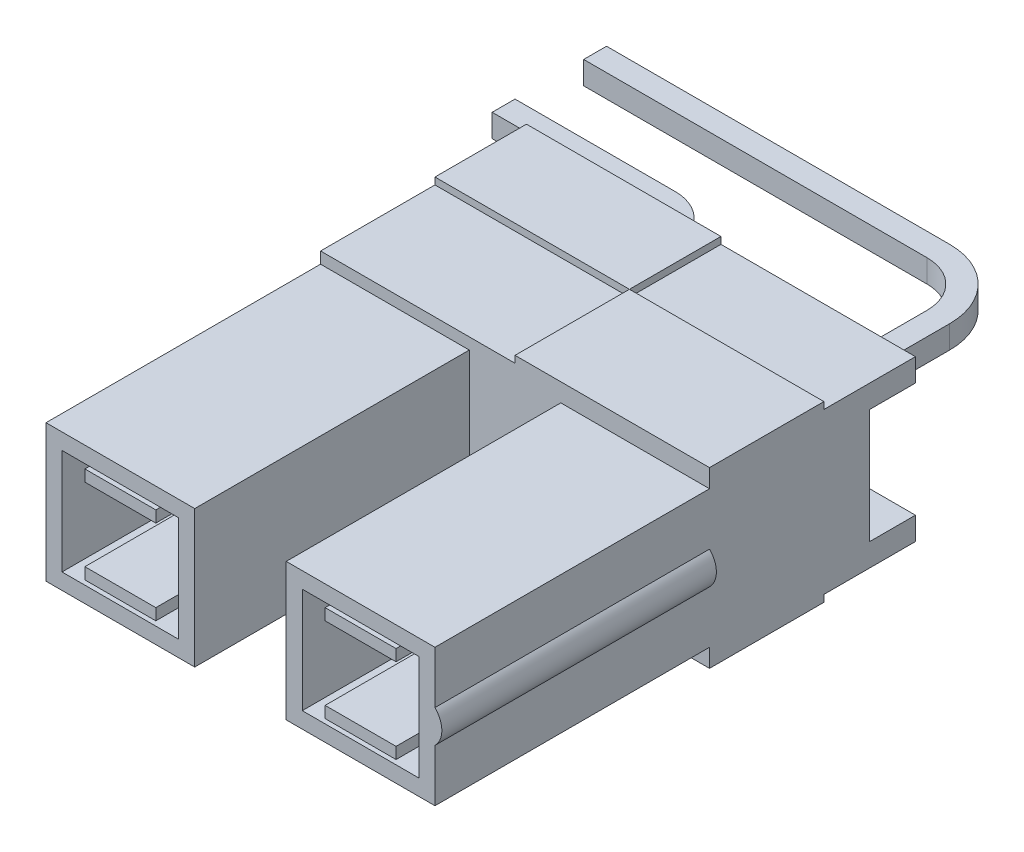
ISO-10303-21;
HEADER;
FILE_DESCRIPTION(('STEP AP214'),'2;1');
FILE_NAME('part.step','',(''),(''),'','','');
FILE_SCHEMA(('AUTOMOTIVE_DESIGN { 1 0 10303 214 1 1 1 1 }'));
ENDSEC;
DATA;
#1=APPLICATION_CONTEXT('core data for automotive mechanical design processes');
#2=APPLICATION_PROTOCOL_DEFINITION('international standard','automotive_design',2000,#1);
#3=PRODUCT_CONTEXT('',#1,'mechanical');
#4=PRODUCT('Part','Part','',(#3));
#5=PRODUCT_RELATED_PRODUCT_CATEGORY('part','',(#4));
#6=PRODUCT_DEFINITION_FORMATION('','',#4);
#7=PRODUCT_DEFINITION_CONTEXT('part definition',#1,'design');
#8=PRODUCT_DEFINITION('design','',#6,#7);
#9=PRODUCT_DEFINITION_SHAPE('','',#8);
#10=(LENGTH_UNIT() NAMED_UNIT(*) SI_UNIT(.MILLI.,.METRE.));
#11=(NAMED_UNIT(*) PLANE_ANGLE_UNIT() SI_UNIT($,.RADIAN.));
#12=(NAMED_UNIT(*) SI_UNIT($,.STERADIAN.) SOLID_ANGLE_UNIT());
#13=UNCERTAINTY_MEASURE_WITH_UNIT(LENGTH_MEASURE(1.E-05),#10,'distance_accuracy_value','');
#14=(GEOMETRIC_REPRESENTATION_CONTEXT(3) GLOBAL_UNCERTAINTY_ASSIGNED_CONTEXT((#13)) GLOBAL_UNIT_ASSIGNED_CONTEXT((#10,
#11,#12)) REPRESENTATION_CONTEXT('',''));
#15=CARTESIAN_POINT('',(0.,0.,0.));
#16=DIRECTION('',(0.,0.,1.));
#17=DIRECTION('',(1.,0.,0.));
#18=AXIS2_PLACEMENT_3D('',#15,#16,#17);
#19=CARTESIAN_POINT('',(2.,-0.249999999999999,-8.5));
#20=DIRECTION('',(1.,0.,0.));
#21=DIRECTION('',(0.,0.,-1.));
#22=AXIS2_PLACEMENT_3D('',#19,#20,#21);
#23=PLANE('',#22);
#24=DIRECTION('',(0.,0.,1.));
#25=VECTOR('',#24,1.);
#26=CARTESIAN_POINT('',(2.,0.250000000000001,-8.5));
#27=LINE('',#26,#25);
#28=CARTESIAN_POINT('',(2.,0.250000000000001,-7.));
#29=VERTEX_POINT('',#28);
#30=CARTESIAN_POINT('',(2.,0.250000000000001,-3.5));
#31=VERTEX_POINT('',#30);
#32=EDGE_CURVE('E600',#29,#31,#27,.T.);
#33=ORIENTED_EDGE('',*,*,#32,.F.);
#34=DIRECTION('',(0.,1.,0.));
#35=VECTOR('',#34,1.);
#36=CARTESIAN_POINT('',(2.,-0.249999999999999,-7.));
#37=LINE('',#36,#35);
#38=CARTESIAN_POINT('',(2.,-0.249999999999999,-7.));
#39=VERTEX_POINT('',#38);
#40=EDGE_CURVE('E52',#29,#39,#37,.F.);
#41=ORIENTED_EDGE('',*,*,#40,.T.);
#42=DIRECTION('',(0.,0.,1.));
#43=VECTOR('',#42,1.);
#44=CARTESIAN_POINT('',(2.,-0.249999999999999,-8.5));
#45=LINE('',#44,#43);
#46=CARTESIAN_POINT('',(2.,-0.25,-3.5));
#47=VERTEX_POINT('',#46);
#48=EDGE_CURVE('E602',#39,#47,#45,.T.);
#49=ORIENTED_EDGE('',*,*,#48,.T.);
#50=DIRECTION('',(0.,1.,0.));
#51=VECTOR('',#50,1.);
#52=CARTESIAN_POINT('',(2.,-0.249999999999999,-3.5));
#53=LINE('',#52,#51);
#54=EDGE_CURVE('E589',#47,#31,#53,.T.);
#55=ORIENTED_EDGE('',*,*,#54,.T.);
#56=EDGE_LOOP('',(#33,#41,#49,#55));
#57=FACE_BOUND('',#56,.T.);
#58=ADVANCED_FACE('F31',(#57),#23,.F.);
#59=CARTESIAN_POINT('',(-2.5,-0.249999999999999,-8.5));
#60=DIRECTION('',(1.,0.,0.));
#61=DIRECTION('',(0.,0.,-1.));
#62=AXIS2_PLACEMENT_3D('',#59,#60,#61);
#63=PLANE('',#62);
#64=DIRECTION('',(0.,0.,1.));
#65=VECTOR('',#64,1.);
#66=CARTESIAN_POINT('',(-2.5,0.250000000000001,-8.5));
#67=LINE('',#66,#65);
#68=CARTESIAN_POINT('',(-2.5,0.250000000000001,-5.5));
#69=VERTEX_POINT('',#68);
#70=CARTESIAN_POINT('',(-2.5,0.250000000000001,-3.5));
#71=VERTEX_POINT('',#70);
#72=EDGE_CURVE('E581',#69,#71,#67,.T.);
#73=ORIENTED_EDGE('',*,*,#72,.F.);
#74=DIRECTION('',(0.,1.,0.));
#75=VECTOR('',#74,1.);
#76=CARTESIAN_POINT('',(-2.5,-0.249999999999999,-5.5));
#77=LINE('',#76,#75);
#78=CARTESIAN_POINT('',(-2.5,-0.249999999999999,-5.5));
#79=VERTEX_POINT('',#78);
#80=EDGE_CURVE('E1087',#69,#79,#77,.F.);
#81=ORIENTED_EDGE('',*,*,#80,.T.);
#82=DIRECTION('',(0.,0.,1.));
#83=VECTOR('',#82,1.);
#84=CARTESIAN_POINT('',(-2.5,-0.249999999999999,-8.5));
#85=LINE('',#84,#83);
#86=CARTESIAN_POINT('',(-2.5,-0.249999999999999,-3.5));
#87=VERTEX_POINT('',#86);
#88=EDGE_CURVE('E575',#79,#87,#85,.T.);
#89=ORIENTED_EDGE('',*,*,#88,.T.);
#90=DIRECTION('',(0.,1.,0.));
#91=VECTOR('',#90,1.);
#92=CARTESIAN_POINT('',(-2.5,-0.249999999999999,-3.5));
#93=LINE('',#92,#91);
#94=EDGE_CURVE('E563',#87,#71,#93,.T.);
#95=ORIENTED_EDGE('',*,*,#94,.T.);
#96=EDGE_LOOP('',(#73,#81,#89,#95));
#97=FACE_BOUND('',#96,.T.);
#98=ADVANCED_FACE('F1144',(#97),#63,.F.);
#99=CARTESIAN_POINT('',(-2.5,0.250000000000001,-8.5));
#100=DIRECTION('',(0.,-1.,0.));
#101=DIRECTION('',(0.,0.,-1.));
#102=AXIS2_PLACEMENT_3D('',#99,#100,#101);
#103=PLANE('',#102);
#104=DIRECTION('',(0.,0.,1.));
#105=VECTOR('',#104,1.);
#106=CARTESIAN_POINT('',(-2.,0.250000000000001,-8.5));
#107=LINE('',#106,#105);
#108=CARTESIAN_POINT('',(-2.,0.250000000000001,-5.5));
#109=VERTEX_POINT('',#108);
#110=CARTESIAN_POINT('',(-2.,0.250000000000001,-3.5));
#111=VERTEX_POINT('',#110);
#112=EDGE_CURVE('E579',#109,#111,#107,.T.);
#113=ORIENTED_EDGE('',*,*,#112,.F.);
#114=CARTESIAN_POINT('',(-3.,0.250000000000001,-5.5));
#115=DIRECTION('',(0.,-1.,0.));
#116=DIRECTION('',(0.,0.,-1.));
#117=AXIS2_PLACEMENT_3D('',#114,#115,#116);
#118=CIRCLE('',#117,1.);
#119=CARTESIAN_POINT('',(-3.,0.250000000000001,-6.5));
#120=VERTEX_POINT('',#119);
#121=EDGE_CURVE('E1100',#109,#120,#118,.F.);
#122=ORIENTED_EDGE('',*,*,#121,.T.);
#123=DIRECTION('',(1.,0.,0.));
#124=VECTOR('',#123,1.);
#125=CARTESIAN_POINT('',(-2.5,0.250000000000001,-6.5));
#126=LINE('',#125,#124);
#127=CARTESIAN_POINT('',(-6.5,0.250000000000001,-6.5));
#128=VERTEX_POINT('',#127);
#129=EDGE_CURVE('E560',#128,#120,#126,.T.);
#130=ORIENTED_EDGE('',*,*,#129,.F.);
#131=DIRECTION('',(0.,0.,-1.));
#132=VECTOR('',#131,1.);
#133=CARTESIAN_POINT('',(-6.5,0.250000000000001,-6.5));
#134=LINE('',#133,#132);
#135=CARTESIAN_POINT('',(-6.5,0.250000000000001,-6.));
#136=VERTEX_POINT('',#135);
#137=EDGE_CURVE('E549',#136,#128,#134,.T.);
#138=ORIENTED_EDGE('',*,*,#137,.F.);
#139=DIRECTION('',(1.,0.,0.));
#140=VECTOR('',#139,1.);
#141=CARTESIAN_POINT('',(-6.5,0.250000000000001,-6.));
#142=LINE('',#141,#140);
#143=CARTESIAN_POINT('',(-3.,0.250000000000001,-6.));
#144=VERTEX_POINT('',#143);
#145=EDGE_CURVE('E552',#136,#144,#142,.T.);
#146=ORIENTED_EDGE('',*,*,#145,.T.);
#147=CARTESIAN_POINT('',(-3.,0.250000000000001,-5.5));
#148=DIRECTION('',(0.,-1.,0.));
#149=DIRECTION('',(0.,0.,-1.));
#150=AXIS2_PLACEMENT_3D('',#147,#148,#149);
#151=CIRCLE('',#150,0.5);
#152=EDGE_CURVE('E1089',#144,#69,#151,.T.);
#153=ORIENTED_EDGE('',*,*,#152,.T.);
#154=ORIENTED_EDGE('',*,*,#72,.T.);
#155=DIRECTION('',(1.,0.,0.));
#156=VECTOR('',#155,1.);
#157=CARTESIAN_POINT('',(-2.5,0.250000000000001,-3.5));
#158=LINE('',#157,#156);
#159=EDGE_CURVE('E566',#71,#111,#158,.T.);
#160=ORIENTED_EDGE('',*,*,#159,.T.);
#161=EDGE_LOOP('',(#113,#122,#130,#138,#146,#153,#154,#160));
#162=FACE_BOUND('',#161,.T.);
#163=ADVANCED_FACE('F1149',(#162),#103,.F.);
#164=CARTESIAN_POINT('',(-2.,-0.249999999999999,-8.5));
#165=DIRECTION('',(-1.,0.,0.));
#166=DIRECTION('',(0.,0.,1.));
#167=AXIS2_PLACEMENT_3D('',#164,#165,#166);
#168=PLANE('',#167);
#169=DIRECTION('',(0.,0.,1.));
#170=VECTOR('',#169,1.);
#171=CARTESIAN_POINT('',(-2.,-0.249999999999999,-8.5));
#172=LINE('',#171,#170);
#173=CARTESIAN_POINT('',(-2.,-0.249999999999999,-5.5));
#174=VERTEX_POINT('',#173);
#175=CARTESIAN_POINT('',(-2.,-0.249999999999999,-3.5));
#176=VERTEX_POINT('',#175);
#177=EDGE_CURVE('E577',#174,#176,#172,.T.);
#178=ORIENTED_EDGE('',*,*,#177,.F.);
#179=DIRECTION('',(0.,-1.,0.));
#180=VECTOR('',#179,1.);
#181=CARTESIAN_POINT('',(-2.,0.250000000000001,-5.5));
#182=LINE('',#181,#180);
#183=EDGE_CURVE('E1098',#174,#109,#182,.F.);
#184=ORIENTED_EDGE('',*,*,#183,.T.);
#185=ORIENTED_EDGE('',*,*,#112,.T.);
#186=DIRECTION('',(0.,-1.,0.));
#187=VECTOR('',#186,1.);
#188=CARTESIAN_POINT('',(-2.,-0.249999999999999,-3.5));
#189=LINE('',#188,#187);
#190=EDGE_CURVE('E569',#111,#176,#189,.T.);
#191=ORIENTED_EDGE('',*,*,#190,.T.);
#192=EDGE_LOOP('',(#178,#184,#185,#191));
#193=FACE_BOUND('',#192,.T.);
#194=ADVANCED_FACE('F1541',(#193),#168,.F.);
#195=CARTESIAN_POINT('',(-2.5,-0.249999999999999,-8.5));
#196=DIRECTION('',(0.,1.,0.));
#197=DIRECTION('',(0.,0.,1.));
#198=AXIS2_PLACEMENT_3D('',#195,#196,#197);
#199=PLANE('',#198);
#200=DIRECTION('',(-1.,0.,0.));
#201=VECTOR('',#200,1.);
#202=CARTESIAN_POINT('',(-2.,-0.249999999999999,-6.5));
#203=LINE('',#202,#201);
#204=CARTESIAN_POINT('',(-3.,-0.249999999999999,-6.5));
#205=VERTEX_POINT('',#204);
#206=CARTESIAN_POINT('',(-6.5,-0.249999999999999,-6.5));
#207=VERTEX_POINT('',#206);
#208=EDGE_CURVE('E558',#205,#207,#203,.T.);
#209=ORIENTED_EDGE('',*,*,#208,.F.);
#210=CARTESIAN_POINT('',(-3.,-0.249999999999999,-5.5));
#211=DIRECTION('',(0.,1.,0.));
#212=DIRECTION('',(0.,0.,1.));
#213=AXIS2_PLACEMENT_3D('',#210,#211,#212);
#214=CIRCLE('',#213,1.);
#215=EDGE_CURVE('E1096',#205,#174,#214,.F.);
#216=ORIENTED_EDGE('',*,*,#215,.T.);
#217=ORIENTED_EDGE('',*,*,#177,.T.);
#218=DIRECTION('',(-1.,0.,0.));
#219=VECTOR('',#218,1.);
#220=CARTESIAN_POINT('',(-2.5,-0.249999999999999,-3.5));
#221=LINE('',#220,#219);
#222=EDGE_CURVE('E572',#176,#87,#221,.T.);
#223=ORIENTED_EDGE('',*,*,#222,.T.);
#224=ORIENTED_EDGE('',*,*,#88,.F.);
#225=CARTESIAN_POINT('',(-3.,-0.249999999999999,-5.5));
#226=DIRECTION('',(0.,1.,0.));
#227=DIRECTION('',(0.,0.,1.));
#228=AXIS2_PLACEMENT_3D('',#225,#226,#227);
#229=CIRCLE('',#228,0.5);
#230=CARTESIAN_POINT('',(-3.,-0.249999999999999,-6.));
#231=VERTEX_POINT('',#230);
#232=EDGE_CURVE('E1091',#79,#231,#229,.T.);
#233=ORIENTED_EDGE('',*,*,#232,.T.);
#234=DIRECTION('',(1.,0.,0.));
#235=VECTOR('',#234,1.);
#236=CARTESIAN_POINT('',(-6.5,-0.249999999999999,-6.));
#237=LINE('',#236,#235);
#238=CARTESIAN_POINT('',(-6.5,-0.249999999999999,-6.));
#239=VERTEX_POINT('',#238);
#240=EDGE_CURVE('E555',#239,#231,#237,.T.);
#241=ORIENTED_EDGE('',*,*,#240,.F.);
#242=DIRECTION('',(0.,0.,1.));
#243=VECTOR('',#242,1.);
#244=CARTESIAN_POINT('',(-6.5,-0.249999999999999,-6.5));
#245=LINE('',#244,#243);
#246=EDGE_CURVE('E544',#207,#239,#245,.T.);
#247=ORIENTED_EDGE('',*,*,#246,.F.);
#248=EDGE_LOOP('',(#209,#216,#217,#223,#224,#233,#241,#247));
#249=FACE_BOUND('',#248,.T.);
#250=ADVANCED_FACE('F1327',(#249),#199,.F.);
#251=CARTESIAN_POINT('',(-4.25005,1.25,-3.5));
#252=DIRECTION('',(0.,0.,1.));
#253=DIRECTION('',(0.,-1.,0.));
#254=AXIS2_PLACEMENT_3D('',#251,#252,#253);
#255=PLANE('',#254);
#256=DIRECTION('',(0.,-1.,0.));
#257=VECTOR('',#256,1.);
#258=CARTESIAN_POINT('',(2.5,-0.249999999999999,-3.5));
#259=LINE('',#258,#257);
#260=CARTESIAN_POINT('',(2.5,0.250000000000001,-3.5));
#261=VERTEX_POINT('',#260);
#262=CARTESIAN_POINT('',(2.5,-0.249999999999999,-3.5));
#263=VERTEX_POINT('',#262);
#264=EDGE_CURVE('E583',#261,#263,#259,.T.);
#265=ORIENTED_EDGE('',*,*,#264,.F.);
#266=DIRECTION('',(1.,0.,0.));
#267=VECTOR('',#266,1.);
#268=CARTESIAN_POINT('',(2.5,0.250000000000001,-3.5));
#269=LINE('',#268,#267);
#270=EDGE_CURVE('E592',#31,#261,#269,.T.);
#271=ORIENTED_EDGE('',*,*,#270,.F.);
#272=ORIENTED_EDGE('',*,*,#54,.F.);
#273=DIRECTION('',(-1.,0.,0.));
#274=VECTOR('',#273,1.);
#275=CARTESIAN_POINT('',(2.5,-0.249999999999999,-3.5));
#276=LINE('',#275,#274);
#277=EDGE_CURVE('E586',#263,#47,#276,.T.);
#278=ORIENTED_EDGE('',*,*,#277,.F.);
#279=EDGE_LOOP('',(#265,#271,#272,#278));
#280=FACE_BOUND('',#279,.T.);
#281=DIRECTION('',(1.,0.,0.));
#282=VECTOR('',#281,1.);
#283=CARTESIAN_POINT('',(-4.25005,1.25,-3.5));
#284=LINE('',#283,#282);
#285=CARTESIAN_POINT('',(-4.25,1.25,-3.5));
#286=VERTEX_POINT('',#285);
#287=CARTESIAN_POINT('',(4.25,1.25,-3.5));
#288=VERTEX_POINT('',#287);
#289=EDGE_CURVE('E909',#286,#288,#284,.T.);
#290=ORIENTED_EDGE('',*,*,#289,.T.);
#291=DIRECTION('',(0.,-1.,0.));
#292=VECTOR('',#291,1.);
#293=CARTESIAN_POINT('',(4.25,1.25,-3.5));
#294=LINE('',#293,#292);
#295=CARTESIAN_POINT('',(4.25,-1.25,-3.5));
#296=VERTEX_POINT('',#295);
#297=EDGE_CURVE('E904',#288,#296,#294,.T.);
#298=ORIENTED_EDGE('',*,*,#297,.T.);
#299=DIRECTION('',(1.,0.,0.));
#300=VECTOR('',#299,1.);
#301=CARTESIAN_POINT('',(-4.25005,-1.25,-3.5));
#302=LINE('',#301,#300);
#303=CARTESIAN_POINT('',(-4.25,-1.25,-3.5));
#304=VERTEX_POINT('',#303);
#305=EDGE_CURVE('E910',#304,#296,#302,.T.);
#306=ORIENTED_EDGE('',*,*,#305,.F.);
#307=DIRECTION('',(0.,-1.,0.));
#308=VECTOR('',#307,1.);
#309=CARTESIAN_POINT('',(-4.25,1.5,-3.5));
#310=LINE('',#309,#308);
#311=EDGE_CURVE('E919',#286,#304,#310,.T.);
#312=ORIENTED_EDGE('',*,*,#311,.F.);
#313=EDGE_LOOP('',(#290,#298,#306,#312));
#314=FACE_BOUND('',#313,.T.);
#315=ORIENTED_EDGE('',*,*,#94,.F.);
#316=ORIENTED_EDGE('',*,*,#222,.F.);
#317=ORIENTED_EDGE('',*,*,#190,.F.);
#318=ORIENTED_EDGE('',*,*,#159,.F.);
#319=EDGE_LOOP('',(#315,#316,#317,#318));
#320=FACE_BOUND('',#319,.T.);
#321=ADVANCED_FACE('F1129',(#280,#314,#320),#255,.F.);
#322=CARTESIAN_POINT('',(4.25,1.75,0.));
#323=DIRECTION('',(0.,0.,1.));
#324=DIRECTION('',(1.,0.,0.));
#325=AXIS2_PLACEMENT_3D('',#322,#323,#324);
#326=PLANE('',#325);
#327=DIRECTION('',(1.,0.,0.));
#328=VECTOR('',#327,1.);
#329=CARTESIAN_POINT('',(-3.4,0.8,0.));
#330=LINE('',#329,#328);
#331=CARTESIAN_POINT('',(-3.4,0.8,0.));
#332=VERTEX_POINT('',#331);
#333=CARTESIAN_POINT('',(-1.85,0.8,0.));
#334=VERTEX_POINT('',#333);
#335=EDGE_CURVE('E711',#332,#334,#330,.T.);
#336=ORIENTED_EDGE('',*,*,#335,.F.);
#337=DIRECTION('',(0.,-1.,0.));
#338=VECTOR('',#337,1.);
#339=CARTESIAN_POINT('',(-3.4,1.05,0.));
#340=LINE('',#339,#338);
#341=CARTESIAN_POINT('',(-3.4,1.05,0.));
#342=VERTEX_POINT('',#341);
#343=EDGE_CURVE('E715',#342,#332,#340,.T.);
#344=ORIENTED_EDGE('',*,*,#343,.F.);
#345=DIRECTION('',(-1.,0.,0.));
#346=VECTOR('',#345,1.);
#347=CARTESIAN_POINT('',(-3.4,1.05,0.));
#348=LINE('',#347,#346);
#349=CARTESIAN_POINT('',(-1.85,1.05,0.));
#350=VERTEX_POINT('',#349);
#351=EDGE_CURVE('E703',#350,#342,#348,.T.);
#352=ORIENTED_EDGE('',*,*,#351,.F.);
#353=DIRECTION('',(0.,1.,0.));
#354=VECTOR('',#353,1.);
#355=CARTESIAN_POINT('',(-1.85,1.05,0.));
#356=LINE('',#355,#354);
#357=EDGE_CURVE('E708',#334,#350,#356,.T.);
#358=ORIENTED_EDGE('',*,*,#357,.F.);
#359=EDGE_LOOP('',(#336,#344,#352,#358));
#360=FACE_BOUND('',#359,.T.);
#361=DIRECTION('',(-1.,0.,0.));
#362=VECTOR('',#361,1.);
#363=CARTESIAN_POINT('',(-3.9,1.15,0.));
#364=LINE('',#363,#362);
#365=CARTESIAN_POINT('',(-1.35,1.15,0.));
#366=VERTEX_POINT('',#365);
#367=CARTESIAN_POINT('',(-3.9,1.15,0.));
#368=VERTEX_POINT('',#367);
#369=EDGE_CURVE('E1454',#366,#368,#364,.T.);
#370=ORIENTED_EDGE('',*,*,#369,.T.);
#371=DIRECTION('',(0.,-1.,0.));
#372=VECTOR('',#371,1.);
#373=CARTESIAN_POINT('',(-3.9,1.15,0.));
#374=LINE('',#373,#372);
#375=CARTESIAN_POINT('',(-3.9,-1.15,0.));
#376=VERTEX_POINT('',#375);
#377=EDGE_CURVE('E1001',#368,#376,#374,.T.);
#378=ORIENTED_EDGE('',*,*,#377,.T.);
#379=DIRECTION('',(1.,0.,0.));
#380=VECTOR('',#379,1.);
#381=CARTESIAN_POINT('',(-3.9,-1.15,0.));
#382=LINE('',#381,#380);
#383=CARTESIAN_POINT('',(-1.35,-1.15,0.));
#384=VERTEX_POINT('',#383);
#385=EDGE_CURVE('E1460',#376,#384,#382,.T.);
#386=ORIENTED_EDGE('',*,*,#385,.T.);
#387=DIRECTION('',(0.,1.,0.));
#388=VECTOR('',#387,1.);
#389=CARTESIAN_POINT('',(-1.35,1.15,0.));
#390=LINE('',#389,#388);
#391=EDGE_CURVE('E1457',#384,#366,#390,.T.);
#392=ORIENTED_EDGE('',*,*,#391,.T.);
#393=EDGE_LOOP('',(#370,#378,#386,#392));
#394=FACE_BOUND('',#393,.T.);
#395=DIRECTION('',(0.,1.,0.));
#396=VECTOR('',#395,1.);
#397=CARTESIAN_POINT('',(-1.85,-1.05,0.));
#398=LINE('',#397,#396);
#399=CARTESIAN_POINT('',(-1.85,-1.05,0.));
#400=VERTEX_POINT('',#399);
#401=CARTESIAN_POINT('',(-1.85,-0.8,0.));
#402=VERTEX_POINT('',#401);
#403=EDGE_CURVE('E615',#400,#402,#398,.T.);
#404=ORIENTED_EDGE('',*,*,#403,.F.);
#405=DIRECTION('',(1.,0.,0.));
#406=VECTOR('',#405,1.);
#407=CARTESIAN_POINT('',(-3.4,-1.05,0.));
#408=LINE('',#407,#406);
#409=CARTESIAN_POINT('',(-3.4,-1.05,0.));
#410=VERTEX_POINT('',#409);
#411=EDGE_CURVE('E619',#410,#400,#408,.T.);
#412=ORIENTED_EDGE('',*,*,#411,.F.);
#413=DIRECTION('',(0.,-1.,0.));
#414=VECTOR('',#413,1.);
#415=CARTESIAN_POINT('',(-3.4,-1.05,0.));
#416=LINE('',#415,#414);
#417=CARTESIAN_POINT('',(-3.4,-0.800000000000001,0.));
#418=VERTEX_POINT('',#417);
#419=EDGE_CURVE('E607',#418,#410,#416,.T.);
#420=ORIENTED_EDGE('',*,*,#419,.F.);
#421=DIRECTION('',(-1.,0.,0.));
#422=VECTOR('',#421,1.);
#423=CARTESIAN_POINT('',(-3.4,-0.8,0.));
#424=LINE('',#423,#422);
#425=EDGE_CURVE('E612',#402,#418,#424,.T.);
#426=ORIENTED_EDGE('',*,*,#425,.F.);
#427=EDGE_LOOP('',(#404,#412,#420,#426));
#428=FACE_BOUND('',#427,.T.);
#429=ADVANCED_FACE('F1326',(#360,#394,#428),#326,.T.);
#430=DIRECTION('',(0.,-1.,0.));
#431=VECTOR('',#430,1.);
#432=CARTESIAN_POINT('',(1.85,1.05,0.));
#433=LINE('',#432,#431);
#434=CARTESIAN_POINT('',(1.85,1.05,0.));
#435=VERTEX_POINT('',#434);
#436=CARTESIAN_POINT('',(1.85,0.8,0.));
#437=VERTEX_POINT('',#436);
#438=EDGE_CURVE('E679',#435,#437,#433,.T.);
#439=ORIENTED_EDGE('',*,*,#438,.F.);
#440=DIRECTION('',(-1.,0.,0.));
#441=VECTOR('',#440,1.);
#442=CARTESIAN_POINT('',(3.4,1.05,0.));
#443=LINE('',#442,#441);
#444=CARTESIAN_POINT('',(3.4,1.05,0.));
#445=VERTEX_POINT('',#444);
#446=EDGE_CURVE('E683',#445,#435,#443,.T.);
#447=ORIENTED_EDGE('',*,*,#446,.F.);
#448=DIRECTION('',(0.,1.,0.));
#449=VECTOR('',#448,1.);
#450=CARTESIAN_POINT('',(3.4,1.05,0.));
#451=LINE('',#450,#449);
#452=CARTESIAN_POINT('',(3.4,0.8,0.));
#453=VERTEX_POINT('',#452);
#454=EDGE_CURVE('E671',#453,#445,#451,.T.);
#455=ORIENTED_EDGE('',*,*,#454,.F.);
#456=DIRECTION('',(1.,0.,0.));
#457=VECTOR('',#456,1.);
#458=CARTESIAN_POINT('',(3.4,0.8,0.));
#459=LINE('',#458,#457);
#460=EDGE_CURVE('E676',#437,#453,#459,.T.);
#461=ORIENTED_EDGE('',*,*,#460,.F.);
#462=EDGE_LOOP('',(#439,#447,#455,#461));
#463=FACE_BOUND('',#462,.T.);
#464=DIRECTION('',(0.,-1.,0.));
#465=VECTOR('',#464,1.);
#466=CARTESIAN_POINT('',(1.35,1.15,0.));
#467=LINE('',#466,#465);
#468=CARTESIAN_POINT('',(1.35,1.15,0.));
#469=VERTEX_POINT('',#468);
#470=CARTESIAN_POINT('',(1.35,-1.15,0.));
#471=VERTEX_POINT('',#470);
#472=EDGE_CURVE('E922',#469,#471,#467,.T.);
#473=ORIENTED_EDGE('',*,*,#472,.T.);
#474=DIRECTION('',(1.,0.,0.));
#475=VECTOR('',#474,1.);
#476=CARTESIAN_POINT('',(1.35,-1.15,0.));
#477=LINE('',#476,#475);
#478=CARTESIAN_POINT('',(3.9,-1.15,0.));
#479=VERTEX_POINT('',#478);
#480=EDGE_CURVE('E924',#471,#479,#477,.T.);
#481=ORIENTED_EDGE('',*,*,#480,.T.);
#482=DIRECTION('',(0.,1.,0.));
#483=VECTOR('',#482,1.);
#484=CARTESIAN_POINT('',(3.9,1.15,0.));
#485=LINE('',#484,#483);
#486=CARTESIAN_POINT('',(3.9,1.15,0.));
#487=VERTEX_POINT('',#486);
#488=EDGE_CURVE('E926',#479,#487,#485,.T.);
#489=ORIENTED_EDGE('',*,*,#488,.T.);
#490=DIRECTION('',(-1.,0.,0.));
#491=VECTOR('',#490,1.);
#492=CARTESIAN_POINT('',(1.35,1.15,0.));
#493=LINE('',#492,#491);
#494=EDGE_CURVE('E928',#487,#469,#493,.T.);
#495=ORIENTED_EDGE('',*,*,#494,.T.);
#496=EDGE_LOOP('',(#473,#481,#489,#495));
#497=FACE_BOUND('',#496,.T.);
#498=DIRECTION('',(0.,1.,0.));
#499=VECTOR('',#498,1.);
#500=CARTESIAN_POINT('',(3.4,-1.05,0.));
#501=LINE('',#500,#499);
#502=CARTESIAN_POINT('',(3.4,-1.05,0.));
#503=VERTEX_POINT('',#502);
#504=CARTESIAN_POINT('',(3.4,-0.8,0.));
#505=VERTEX_POINT('',#504);
#506=EDGE_CURVE('E647',#503,#505,#501,.T.);
#507=ORIENTED_EDGE('',*,*,#506,.F.);
#508=DIRECTION('',(1.,0.,0.));
#509=VECTOR('',#508,1.);
#510=CARTESIAN_POINT('',(3.4,-1.05,0.));
#511=LINE('',#510,#509);
#512=CARTESIAN_POINT('',(1.85,-1.05,0.));
#513=VERTEX_POINT('',#512);
#514=EDGE_CURVE('E651',#513,#503,#511,.T.);
#515=ORIENTED_EDGE('',*,*,#514,.F.);
#516=DIRECTION('',(0.,-1.,0.));
#517=VECTOR('',#516,1.);
#518=CARTESIAN_POINT('',(1.85,-1.05,0.));
#519=LINE('',#518,#517);
#520=CARTESIAN_POINT('',(1.85,-0.800000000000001,0.));
#521=VERTEX_POINT('',#520);
#522=EDGE_CURVE('E639',#521,#513,#519,.T.);
#523=ORIENTED_EDGE('',*,*,#522,.F.);
#524=DIRECTION('',(-1.,0.,0.));
#525=VECTOR('',#524,1.);
#526=CARTESIAN_POINT('',(3.4,-0.8,0.));
#527=LINE('',#526,#525);
#528=EDGE_CURVE('E644',#505,#521,#527,.T.);
#529=ORIENTED_EDGE('',*,*,#528,.F.);
#530=EDGE_LOOP('',(#507,#515,#523,#529));
#531=FACE_BOUND('',#530,.T.);
#532=ADVANCED_FACE('F1365',(#463,#497,#531),#326,.T.);
#533=CARTESIAN_POINT('',(4.25,-1.75,-4.5));
#534=DIRECTION('',(0.,1.,0.));
#535=DIRECTION('',(0.,0.,1.));
#536=AXIS2_PLACEMENT_3D('',#533,#534,#535);
#537=PLANE('',#536);
#538=CARTESIAN_POINT('',(0.,-1.75,-2.5));
#539=DIRECTION('',(0.,1.,0.));
#540=DIRECTION('',(0.,0.,1.));
#541=AXIS2_PLACEMENT_3D('',#538,#539,#540);
#542=CIRCLE('',#541,0.0101028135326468);
#543=CARTESIAN_POINT('',(0.0101028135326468,-1.75,-2.5));
#544=VERTEX_POINT('',#543);
#545=CARTESIAN_POINT('',(0.,-1.75,-2.51010281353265));
#546=VERTEX_POINT('',#545);
#547=EDGE_CURVE('E737',#544,#546,#542,.T.);
#548=ORIENTED_EDGE('',*,*,#547,.T.);
#549=DIRECTION('',(0.,0.,-1.));
#550=VECTOR('',#549,1.);
#551=CARTESIAN_POINT('',(0.,-1.75,-4.5));
#552=LINE('',#551,#550);
#553=CARTESIAN_POINT('',(0.,-1.75,-4.5));
#554=VERTEX_POINT('',#553);
#555=EDGE_CURVE('E721',#546,#554,#552,.T.);
#556=ORIENTED_EDGE('',*,*,#555,.T.);
#557=DIRECTION('',(-1.,0.,0.));
#558=VECTOR('',#557,1.);
#559=CARTESIAN_POINT('',(4.25,-1.75,-4.5));
#560=LINE('',#559,#558);
#561=CARTESIAN_POINT('',(4.25,-1.75,-4.5));
#562=VERTEX_POINT('',#561);
#563=EDGE_CURVE('E1015',#562,#554,#560,.T.);
#564=ORIENTED_EDGE('',*,*,#563,.F.);
#565=DIRECTION('',(0.,0.,1.));
#566=VECTOR('',#565,1.);
#567=CARTESIAN_POINT('',(4.25,-1.75,-4.5));
#568=LINE('',#567,#566);
#569=CARTESIAN_POINT('',(4.25,-1.75,-2.5));
#570=VERTEX_POINT('',#569);
#571=EDGE_CURVE('E998',#562,#570,#568,.T.);
#572=ORIENTED_EDGE('',*,*,#571,.T.);
#573=DIRECTION('',(-1.,0.,0.));
#574=VECTOR('',#573,1.);
#575=CARTESIAN_POINT('',(4.25,-1.75,-2.5));
#576=LINE('',#575,#574);
#577=EDGE_CURVE('E740',#570,#544,#576,.T.);
#578=ORIENTED_EDGE('',*,*,#577,.T.);
#579=EDGE_LOOP('',(#548,#556,#564,#572,#578));
#580=FACE_BOUND('',#579,.T.);
#581=ADVANCED_FACE('F1374',(#580),#537,.F.);
#582=CARTESIAN_POINT('',(4.25,1.75,-4.5));
#583=DIRECTION('',(0.,-1.,0.));
#584=DIRECTION('',(0.,0.,-1.));
#585=AXIS2_PLACEMENT_3D('',#582,#583,#584);
#586=PLANE('',#585);
#587=DIRECTION('',(1.,0.,0.));
#588=VECTOR('',#587,1.);
#589=CARTESIAN_POINT('',(-4.25,1.75,-2.5));
#590=LINE('',#589,#588);
#591=CARTESIAN_POINT('',(-4.25,1.75,-2.5));
#592=VERTEX_POINT('',#591);
#593=CARTESIAN_POINT('',(-0.0101028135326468,1.75,-2.5));
#594=VERTEX_POINT('',#593);
#595=EDGE_CURVE('E799',#592,#594,#590,.T.);
#596=ORIENTED_EDGE('',*,*,#595,.F.);
#597=DIRECTION('',(0.,0.,1.));
#598=VECTOR('',#597,1.);
#599=CARTESIAN_POINT('',(-4.25,1.75,-4.5));
#600=LINE('',#599,#598);
#601=CARTESIAN_POINT('',(-4.25,1.75,0.));
#602=VERTEX_POINT('',#601);
#603=EDGE_CURVE('E1004',#592,#602,#600,.T.);
#604=ORIENTED_EDGE('',*,*,#603,.T.);
#605=DIRECTION('',(1.,0.,0.));
#606=VECTOR('',#605,1.);
#607=CARTESIAN_POINT('',(4.25,1.75,0.));
#608=LINE('',#607,#606);
#609=CARTESIAN_POINT('',(0.,1.75,0.));
#610=VERTEX_POINT('',#609);
#611=EDGE_CURVE('E989',#602,#610,#608,.T.);
#612=ORIENTED_EDGE('',*,*,#611,.T.);
#613=DIRECTION('',(0.,0.,1.));
#614=VECTOR('',#613,1.);
#615=CARTESIAN_POINT('',(0.,1.75,0.));
#616=LINE('',#615,#614);
#617=CARTESIAN_POINT('',(0.,1.75,-2.48989718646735));
#618=VERTEX_POINT('',#617);
#619=EDGE_CURVE('E803',#618,#610,#616,.T.);
#620=ORIENTED_EDGE('',*,*,#619,.F.);
#621=CARTESIAN_POINT('',(0.,1.75,-2.5));
#622=DIRECTION('',(0.,1.,0.));
#623=DIRECTION('',(0.,0.,1.));
#624=AXIS2_PLACEMENT_3D('',#621,#622,#623);
#625=CIRCLE('',#624,0.0101028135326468);
#626=EDGE_CURVE('E801',#594,#618,#625,.T.);
#627=ORIENTED_EDGE('',*,*,#626,.F.);
#628=EDGE_LOOP('',(#596,#604,#612,#620,#627));
#629=FACE_BOUND('',#628,.T.);
#630=ADVANCED_FACE('F1032',(#629),#586,.F.);
#631=DIRECTION('',(-1.,0.,0.));
#632=VECTOR('',#631,1.);
#633=CARTESIAN_POINT('',(4.25,1.75,-2.5));
#634=LINE('',#633,#632);
#635=CARTESIAN_POINT('',(4.25,1.75,-2.5));
#636=VERTEX_POINT('',#635);
#637=CARTESIAN_POINT('',(0.0101028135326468,1.75,-2.5));
#638=VERTEX_POINT('',#637);
#639=EDGE_CURVE('E805',#636,#638,#634,.T.);
#640=ORIENTED_EDGE('',*,*,#639,.F.);
#641=DIRECTION('',(0.,0.,1.));
#642=VECTOR('',#641,1.);
#643=CARTESIAN_POINT('',(4.25,1.75,-4.5));
#644=LINE('',#643,#642);
#645=CARTESIAN_POINT('',(4.25,1.75,-4.5));
#646=VERTEX_POINT('',#645);
#647=EDGE_CURVE('E1006',#646,#636,#644,.T.);
#648=ORIENTED_EDGE('',*,*,#647,.F.);
#649=DIRECTION('',(1.,0.,0.));
#650=VECTOR('',#649,1.);
#651=CARTESIAN_POINT('',(4.25,1.75,-4.5));
#652=LINE('',#651,#650);
#653=CARTESIAN_POINT('',(0.,1.75,-4.5));
#654=VERTEX_POINT('',#653);
#655=EDGE_CURVE('E1009',#654,#646,#652,.T.);
#656=ORIENTED_EDGE('',*,*,#655,.F.);
#657=DIRECTION('',(0.,0.,-1.));
#658=VECTOR('',#657,1.);
#659=CARTESIAN_POINT('',(0.,1.75,-4.5));
#660=LINE('',#659,#658);
#661=CARTESIAN_POINT('',(0.,1.75,-2.51010281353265));
#662=VERTEX_POINT('',#661);
#663=EDGE_CURVE('E809',#662,#654,#660,.T.);
#664=ORIENTED_EDGE('',*,*,#663,.F.);
#665=CARTESIAN_POINT('',(0.,1.75,-2.5));
#666=DIRECTION('',(0.,1.,0.));
#667=DIRECTION('',(0.,0.,1.));
#668=AXIS2_PLACEMENT_3D('',#665,#666,#667);
#669=CIRCLE('',#668,0.0101028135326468);
#670=EDGE_CURVE('E807',#638,#662,#669,.T.);
#671=ORIENTED_EDGE('',*,*,#670,.F.);
#672=EDGE_LOOP('',(#640,#648,#656,#664,#671));
#673=FACE_BOUND('',#672,.T.);
#674=ADVANCED_FACE('F1373',(#673),#586,.F.);
#675=CARTESIAN_POINT('',(-4.25,1.5,6.));
#676=DIRECTION('',(1.,0.,0.));
#677=DIRECTION('',(0.,0.,-1.));
#678=AXIS2_PLACEMENT_3D('',#675,#676,#677);
#679=PLANE('',#678);
#680=ORIENTED_EDGE('',*,*,#311,.T.);
#681=DIRECTION('',(0.,0.,-1.));
#682=VECTOR('',#681,1.);
#683=CARTESIAN_POINT('',(-4.25,-1.25,6.));
#684=LINE('',#683,#682);
#685=CARTESIAN_POINT('',(-4.25,-1.25,-4.5));
#686=VERTEX_POINT('',#685);
#687=EDGE_CURVE('E916',#304,#686,#684,.T.);
#688=ORIENTED_EDGE('',*,*,#687,.T.);
#689=DIRECTION('',(0.,1.,0.));
#690=VECTOR('',#689,1.);
#691=CARTESIAN_POINT('',(-4.25,-1.75,-4.5));
#692=LINE('',#691,#690);
#693=CARTESIAN_POINT('',(-4.25,-1.9,-4.5));
#694=VERTEX_POINT('',#693);
#695=EDGE_CURVE('E1011',#694,#686,#692,.T.);
#696=ORIENTED_EDGE('',*,*,#695,.F.);
#697=DIRECTION('',(0.,0.,1.));
#698=VECTOR('',#697,1.);
#699=CARTESIAN_POINT('',(-4.25,-1.9,-4.5));
#700=LINE('',#699,#698);
#701=CARTESIAN_POINT('',(-4.25,-1.9,-2.5));
#702=VERTEX_POINT('',#701);
#703=EDGE_CURVE('E752',#694,#702,#700,.T.);
#704=ORIENTED_EDGE('',*,*,#703,.T.);
#705=DIRECTION('',(0.,1.,0.));
#706=VECTOR('',#705,1.);
#707=CARTESIAN_POINT('',(-4.25,-1.9,-2.5));
#708=LINE('',#707,#706);
#709=CARTESIAN_POINT('',(-4.25,-1.75,-2.5));
#710=VERTEX_POINT('',#709);
#711=EDGE_CURVE('E782',#702,#710,#708,.T.);
#712=ORIENTED_EDGE('',*,*,#711,.T.);
#713=DIRECTION('',(0.,0.,1.));
#714=VECTOR('',#713,1.);
#715=CARTESIAN_POINT('',(-4.25,-1.75,-4.5));
#716=LINE('',#715,#714);
#717=CARTESIAN_POINT('',(-4.25,-1.75,0.));
#718=VERTEX_POINT('',#717);
#719=EDGE_CURVE('E1002',#710,#718,#716,.T.);
#720=ORIENTED_EDGE('',*,*,#719,.T.);
#721=DIRECTION('',(0.,1.,0.));
#722=VECTOR('',#721,1.);
#723=CARTESIAN_POINT('',(-4.25,-1.75,0.));
#724=LINE('',#723,#722);
#725=CARTESIAN_POINT('',(-4.25,-1.5,0.));
#726=VERTEX_POINT('',#725);
#727=EDGE_CURVE('E995',#718,#726,#724,.T.);
#728=ORIENTED_EDGE('',*,*,#727,.T.);
#729=DIRECTION('',(0.,0.,-1.));
#730=VECTOR('',#729,1.);
#731=CARTESIAN_POINT('',(-4.25,-1.5,6.));
#732=LINE('',#731,#730);
#733=CARTESIAN_POINT('',(-4.25,-1.5,6.));
#734=VERTEX_POINT('',#733);
#735=EDGE_CURVE('E1082',#734,#726,#732,.T.);
#736=ORIENTED_EDGE('',*,*,#735,.F.);
#737=DIRECTION('',(0.,-1.,0.));
#738=VECTOR('',#737,1.);
#739=CARTESIAN_POINT('',(-4.25,1.5,6.));
#740=LINE('',#739,#738);
#741=CARTESIAN_POINT('',(-4.25,1.5,6.));
#742=VERTEX_POINT('',#741);
#743=EDGE_CURVE('E1061',#742,#734,#740,.T.);
#744=ORIENTED_EDGE('',*,*,#743,.F.);
#745=DIRECTION('',(0.,0.,-1.));
#746=VECTOR('',#745,1.);
#747=CARTESIAN_POINT('',(-4.25,1.5,6.));
#748=LINE('',#747,#746);
#749=CARTESIAN_POINT('',(-4.25,1.5,0.));
#750=VERTEX_POINT('',#749);
#751=EDGE_CURVE('E1058',#742,#750,#748,.T.);
#752=ORIENTED_EDGE('',*,*,#751,.T.);
#753=EDGE_CURVE('E986',#750,#602,#724,.T.);
#754=ORIENTED_EDGE('',*,*,#753,.T.);
#755=ORIENTED_EDGE('',*,*,#603,.F.);
#756=DIRECTION('',(0.,-1.,0.));
#757=VECTOR('',#756,1.);
#758=CARTESIAN_POINT('',(-4.25,1.9,-2.5));
#759=LINE('',#758,#757);
#760=CARTESIAN_POINT('',(-4.25,1.9,-2.5));
#761=VERTEX_POINT('',#760);
#762=EDGE_CURVE('E854',#761,#592,#759,.T.);
#763=ORIENTED_EDGE('',*,*,#762,.F.);
#764=DIRECTION('',(0.,0.,1.));
#765=VECTOR('',#764,1.);
#766=CARTESIAN_POINT('',(-4.25,1.9,-4.5));
#767=LINE('',#766,#765);
#768=CARTESIAN_POINT('',(-4.25,1.9,-4.5));
#769=VERTEX_POINT('',#768);
#770=EDGE_CURVE('E812',#769,#761,#767,.T.);
#771=ORIENTED_EDGE('',*,*,#770,.F.);
#772=CARTESIAN_POINT('',(-4.25,1.25,-4.5));
#773=VERTEX_POINT('',#772);
#774=EDGE_CURVE('E1014',#773,#769,#692,.T.);
#775=ORIENTED_EDGE('',*,*,#774,.F.);
#776=DIRECTION('',(0.,0.,1.));
#777=VECTOR('',#776,1.);
#778=CARTESIAN_POINT('',(-4.25,1.25,6.));
#779=LINE('',#778,#777);
#780=EDGE_CURVE('E912',#773,#286,#779,.T.);
#781=ORIENTED_EDGE('',*,*,#780,.T.);
#782=EDGE_LOOP('',(#680,#688,#696,#704,#712,#720,#728,#736,#744,#752,#754,#755,#763,#771,#775,#781));
#783=FACE_BOUND('',#782,.T.);
#784=CARTESIAN_POINT('',(-4.25,0.,-0.2));
#785=DIRECTION('',(-1.,0.,0.));
#786=DIRECTION('',(0.,0.,1.));
#787=AXIS2_PLACEMENT_3D('',#784,#785,#786);
#788=CIRCLE('',#787,0.25);
#789=CARTESIAN_POINT('',(-4.25,0.25,-0.2));
#790=VERTEX_POINT('',#789);
#791=CARTESIAN_POINT('',(-4.25,-0.25,-0.200000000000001));
#792=VERTEX_POINT('',#791);
#793=EDGE_CURVE('E856',#790,#792,#788,.T.);
#794=ORIENTED_EDGE('',*,*,#793,.F.);
#795=DIRECTION('',(0.,0.,-1.));
#796=VECTOR('',#795,1.);
#797=CARTESIAN_POINT('',(-4.25,0.25,-0.2));
#798=LINE('',#797,#796);
#799=CARTESIAN_POINT('',(-4.25,0.25,0.200000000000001));
#800=VERTEX_POINT('',#799);
#801=EDGE_CURVE('E865',#800,#790,#798,.T.);
#802=ORIENTED_EDGE('',*,*,#801,.F.);
#803=CARTESIAN_POINT('',(-4.25,0.,0.2));
#804=DIRECTION('',(-1.,0.,0.));
#805=DIRECTION('',(0.,0.,1.));
#806=AXIS2_PLACEMENT_3D('',#803,#804,#805);
#807=CIRCLE('',#806,0.25);
#808=CARTESIAN_POINT('',(-4.25,-0.25,0.2));
#809=VERTEX_POINT('',#808);
#810=EDGE_CURVE('E862',#809,#800,#807,.T.);
#811=ORIENTED_EDGE('',*,*,#810,.F.);
#812=DIRECTION('',(0.,0.,1.));
#813=VECTOR('',#812,1.);
#814=CARTESIAN_POINT('',(-4.25,-0.25,-0.2));
#815=LINE('',#814,#813);
#816=EDGE_CURVE('E859',#792,#809,#815,.T.);
#817=ORIENTED_EDGE('',*,*,#816,.F.);
#818=EDGE_LOOP('',(#794,#802,#811,#817));
#819=FACE_BOUND('',#818,.T.);
#820=ADVANCED_FACE('F33',(#783,#819),#679,.F.);
#821=CARTESIAN_POINT('',(4.25,1.75,-4.5));
#822=DIRECTION('',(0.,0.,1.));
#823=DIRECTION('',(1.,0.,0.));
#824=AXIS2_PLACEMENT_3D('',#821,#822,#823);
#825=PLANE('',#824);
#826=ORIENTED_EDGE('',*,*,#695,.T.);
#827=DIRECTION('',(1.,0.,0.));
#828=VECTOR('',#827,1.);
#829=CARTESIAN_POINT('',(4.25,-1.25,-4.5));
#830=LINE('',#829,#828);
#831=CARTESIAN_POINT('',(4.25,-1.25,-4.5));
#832=VERTEX_POINT('',#831);
#833=EDGE_CURVE('E1081',#686,#832,#830,.T.);
#834=ORIENTED_EDGE('',*,*,#833,.T.);
#835=DIRECTION('',(0.,-1.,0.));
#836=VECTOR('',#835,1.);
#837=CARTESIAN_POINT('',(4.25,-1.75,-4.5));
#838=LINE('',#837,#836);
#839=EDGE_CURVE('E1019',#832,#562,#838,.T.);
#840=ORIENTED_EDGE('',*,*,#839,.T.);
#841=ORIENTED_EDGE('',*,*,#563,.T.);
#842=DIRECTION('',(0.,1.,0.));
#843=VECTOR('',#842,1.);
#844=CARTESIAN_POINT('',(0.,-1.9,-4.5));
#845=LINE('',#844,#843);
#846=CARTESIAN_POINT('',(0.,-1.9,-4.5));
#847=VERTEX_POINT('',#846);
#848=EDGE_CURVE('E797',#847,#554,#845,.T.);
#849=ORIENTED_EDGE('',*,*,#848,.F.);
#850=DIRECTION('',(-1.,0.,0.));
#851=VECTOR('',#850,1.);
#852=CARTESIAN_POINT('',(-4.25,-1.9,-4.5));
#853=LINE('',#852,#851);
#854=EDGE_CURVE('E755',#847,#694,#853,.T.);
#855=ORIENTED_EDGE('',*,*,#854,.T.);
#856=EDGE_LOOP('',(#826,#834,#840,#841,#849,#855));
#857=FACE_BOUND('',#856,.T.);
#858=ADVANCED_FACE('F1370',(#857),#825,.F.);
#859=DIRECTION('',(0.,-1.,0.));
#860=VECTOR('',#859,1.);
#861=CARTESIAN_POINT('',(4.25,-1.75,0.));
#862=LINE('',#861,#860);
#863=CARTESIAN_POINT('',(4.25,-1.5,0.));
#864=VERTEX_POINT('',#863);
#865=CARTESIAN_POINT('',(4.25,-1.9,0.));
#866=VERTEX_POINT('',#865);
#867=EDGE_CURVE('E979',#864,#866,#862,.T.);
#868=ORIENTED_EDGE('',*,*,#867,.F.);
#869=DIRECTION('',(1.,0.,0.));
#870=VECTOR('',#869,1.);
#871=CARTESIAN_POINT('',(1.,-1.5,0.));
#872=LINE('',#871,#870);
#873=CARTESIAN_POINT('',(1.,-1.5,0.));
#874=VERTEX_POINT('',#873);
#875=EDGE_CURVE('E951',#874,#864,#872,.T.);
#876=ORIENTED_EDGE('',*,*,#875,.F.);
#877=DIRECTION('',(0.,-1.,0.));
#878=VECTOR('',#877,1.);
#879=CARTESIAN_POINT('',(1.,1.5,0.));
#880=LINE('',#879,#878);
#881=CARTESIAN_POINT('',(1.,1.5,0.));
#882=VERTEX_POINT('',#881);
#883=EDGE_CURVE('E955',#882,#874,#880,.T.);
#884=ORIENTED_EDGE('',*,*,#883,.F.);
#885=DIRECTION('',(-1.,0.,0.));
#886=VECTOR('',#885,1.);
#887=CARTESIAN_POINT('',(1.,1.5,0.));
#888=LINE('',#887,#886);
#889=CARTESIAN_POINT('',(4.25,1.5,0.));
#890=VERTEX_POINT('',#889);
#891=EDGE_CURVE('E953',#890,#882,#888,.T.);
#892=ORIENTED_EDGE('',*,*,#891,.F.);
#893=CARTESIAN_POINT('',(4.25,1.9,0.));
#894=VERTEX_POINT('',#893);
#895=EDGE_CURVE('E980',#894,#890,#862,.T.);
#896=ORIENTED_EDGE('',*,*,#895,.F.);
#897=DIRECTION('',(1.,0.,0.));
#898=VECTOR('',#897,1.);
#899=CARTESIAN_POINT('',(4.25,1.9,0.));
#900=LINE('',#899,#898);
#901=CARTESIAN_POINT('',(0.,1.9,0.));
#902=VERTEX_POINT('',#901);
#903=EDGE_CURVE('E821',#902,#894,#900,.T.);
#904=ORIENTED_EDGE('',*,*,#903,.F.);
#905=DIRECTION('',(0.,-1.,0.));
#906=VECTOR('',#905,1.);
#907=CARTESIAN_POINT('',(0.,1.9,0.));
#908=LINE('',#907,#906);
#909=EDGE_CURVE('E845',#902,#610,#908,.T.);
#910=ORIENTED_EDGE('',*,*,#909,.T.);
#911=ORIENTED_EDGE('',*,*,#611,.F.);
#912=ORIENTED_EDGE('',*,*,#753,.F.);
#913=DIRECTION('',(-1.,0.,0.));
#914=VECTOR('',#913,1.);
#915=CARTESIAN_POINT('',(-4.25,1.5,0.));
#916=LINE('',#915,#914);
#917=CARTESIAN_POINT('',(-1.,1.5,0.));
#918=VERTEX_POINT('',#917);
#919=EDGE_CURVE('E1074',#918,#750,#916,.T.);
#920=ORIENTED_EDGE('',*,*,#919,.F.);
#921=DIRECTION('',(0.,1.,0.));
#922=VECTOR('',#921,1.);
#923=CARTESIAN_POINT('',(-1.,1.5,0.));
#924=LINE('',#923,#922);
#925=CARTESIAN_POINT('',(-1.,-1.5,0.));
#926=VERTEX_POINT('',#925);
#927=EDGE_CURVE('E1420',#926,#918,#924,.T.);
#928=ORIENTED_EDGE('',*,*,#927,.F.);
#929=DIRECTION('',(1.,0.,0.));
#930=VECTOR('',#929,1.);
#931=CARTESIAN_POINT('',(-4.25,-1.5,0.));
#932=LINE('',#931,#930);
#933=EDGE_CURVE('E1416',#726,#926,#932,.T.);
#934=ORIENTED_EDGE('',*,*,#933,.F.);
#935=ORIENTED_EDGE('',*,*,#727,.F.);
#936=DIRECTION('',(-1.,0.,0.));
#937=VECTOR('',#936,1.);
#938=CARTESIAN_POINT('',(4.25,-1.75,0.));
#939=LINE('',#938,#937);
#940=CARTESIAN_POINT('',(0.,-1.75,0.));
#941=VERTEX_POINT('',#940);
#942=EDGE_CURVE('E983',#941,#718,#939,.T.);
#943=ORIENTED_EDGE('',*,*,#942,.F.);
#944=DIRECTION('',(0.,1.,0.));
#945=VECTOR('',#944,1.);
#946=CARTESIAN_POINT('',(0.,-1.9,0.));
#947=LINE('',#946,#945);
#948=CARTESIAN_POINT('',(0.,-1.9,0.));
#949=VERTEX_POINT('',#948);
#950=EDGE_CURVE('E789',#949,#941,#947,.T.);
#951=ORIENTED_EDGE('',*,*,#950,.F.);
#952=DIRECTION('',(1.,0.,0.));
#953=VECTOR('',#952,1.);
#954=CARTESIAN_POINT('',(4.25,-1.9,0.));
#955=LINE('',#954,#953);
#956=EDGE_CURVE('E770',#949,#866,#955,.T.);
#957=ORIENTED_EDGE('',*,*,#956,.T.);
#958=EDGE_LOOP('',(#868,#876,#884,#892,#896,#904,#910,#911,#912,#920,#928,#934,#935,#943,#951,#957));
#959=FACE_BOUND('',#958,.T.);
#960=ADVANCED_FACE('F1038',(#959),#326,.T.);
#961=CARTESIAN_POINT('',(-4.25,-1.5,6.));
#962=DIRECTION('',(0.,0.,1.));
#963=DIRECTION('',(1.,0.,0.));
#964=AXIS2_PLACEMENT_3D('',#961,#962,#963);
#965=PLANE('',#964);
#966=ORIENTED_EDGE('',*,*,#743,.T.);
#967=DIRECTION('',(1.,0.,0.));
#968=VECTOR('',#967,1.);
#969=CARTESIAN_POINT('',(-4.25,-1.5,6.));
#970=LINE('',#969,#968);
#971=CARTESIAN_POINT('',(-1.,-1.5,6.));
#972=VERTEX_POINT('',#971);
#973=EDGE_CURVE('E1432',#734,#972,#970,.T.);
#974=ORIENTED_EDGE('',*,*,#973,.T.);
#975=DIRECTION('',(0.,1.,0.));
#976=VECTOR('',#975,1.);
#977=CARTESIAN_POINT('',(-1.,1.5,6.));
#978=LINE('',#977,#976);
#979=CARTESIAN_POINT('',(-1.,1.5,6.));
#980=VERTEX_POINT('',#979);
#981=EDGE_CURVE('E1070',#972,#980,#978,.T.);
#982=ORIENTED_EDGE('',*,*,#981,.T.);
#983=DIRECTION('',(-1.,0.,0.));
#984=VECTOR('',#983,1.);
#985=CARTESIAN_POINT('',(-4.25,1.5,6.));
#986=LINE('',#985,#984);
#987=EDGE_CURVE('E1065',#980,#742,#986,.T.);
#988=ORIENTED_EDGE('',*,*,#987,.T.);
#989=EDGE_LOOP('',(#966,#974,#982,#988));
#990=FACE_BOUND('',#989,.T.);
#991=DIRECTION('',(1.,0.,0.));
#992=VECTOR('',#991,1.);
#993=CARTESIAN_POINT('',(-3.9,-1.15,6.));
#994=LINE('',#993,#992);
#995=CARTESIAN_POINT('',(-3.9,-1.15,6.));
#996=VERTEX_POINT('',#995);
#997=CARTESIAN_POINT('',(-1.35,-1.15,6.));
#998=VERTEX_POINT('',#997);
#999=EDGE_CURVE('E1450',#996,#998,#994,.T.);
#1000=ORIENTED_EDGE('',*,*,#999,.F.);
#1001=DIRECTION('',(0.,-1.,0.));
#1002=VECTOR('',#1001,1.);
#1003=CARTESIAN_POINT('',(-3.9,1.15,6.));
#1004=LINE('',#1003,#1002);
#1005=CARTESIAN_POINT('',(-3.9,1.15,6.));
#1006=VERTEX_POINT('',#1005);
#1007=EDGE_CURVE('E1452',#1006,#996,#1004,.T.);
#1008=ORIENTED_EDGE('',*,*,#1007,.F.);
#1009=DIRECTION('',(-1.,0.,0.));
#1010=VECTOR('',#1009,1.);
#1011=CARTESIAN_POINT('',(-3.9,1.15,6.));
#1012=LINE('',#1011,#1010);
#1013=CARTESIAN_POINT('',(-1.35,1.15,6.));
#1014=VERTEX_POINT('',#1013);
#1015=EDGE_CURVE('E1445',#1014,#1006,#1012,.T.);
#1016=ORIENTED_EDGE('',*,*,#1015,.F.);
#1017=DIRECTION('',(0.,1.,0.));
#1018=VECTOR('',#1017,1.);
#1019=CARTESIAN_POINT('',(-1.35,1.15,6.));
#1020=LINE('',#1019,#1018);
#1021=EDGE_CURVE('E1447',#998,#1014,#1020,.T.);
#1022=ORIENTED_EDGE('',*,*,#1021,.F.);
#1023=EDGE_LOOP('',(#1000,#1008,#1016,#1022));
#1024=FACE_BOUND('',#1023,.T.);
#1025=ADVANCED_FACE('F1399',(#990,#1024),#965,.T.);
#1026=CARTESIAN_POINT('',(-4.25,-1.5,6.));
#1027=DIRECTION('',(0.,1.,0.));
#1028=DIRECTION('',(0.,0.,1.));
#1029=AXIS2_PLACEMENT_3D('',#1026,#1027,#1028);
#1030=PLANE('',#1029);
#1031=ORIENTED_EDGE('',*,*,#933,.T.);
#1032=DIRECTION('',(0.,0.,-1.));
#1033=VECTOR('',#1032,1.);
#1034=CARTESIAN_POINT('',(-1.,-1.5,6.));
#1035=LINE('',#1034,#1033);
#1036=EDGE_CURVE('E1068',#972,#926,#1035,.T.);
#1037=ORIENTED_EDGE('',*,*,#1036,.F.);
#1038=ORIENTED_EDGE('',*,*,#973,.F.);
#1039=ORIENTED_EDGE('',*,*,#735,.T.);
#1040=EDGE_LOOP('',(#1031,#1037,#1038,#1039));
#1041=FACE_BOUND('',#1040,.T.);
#1042=ADVANCED_FACE('F1402',(#1041),#1030,.F.);
#1043=CARTESIAN_POINT('',(-1.,1.5,6.));
#1044=DIRECTION('',(-1.,0.,0.));
#1045=DIRECTION('',(0.,-1.,0.));
#1046=AXIS2_PLACEMENT_3D('',#1043,#1044,#1045);
#1047=PLANE('',#1046);
#1048=ORIENTED_EDGE('',*,*,#927,.T.);
#1049=DIRECTION('',(0.,0.,-1.));
#1050=VECTOR('',#1049,1.);
#1051=CARTESIAN_POINT('',(-1.,1.5,6.));
#1052=LINE('',#1051,#1050);
#1053=EDGE_CURVE('E1064',#980,#918,#1052,.T.);
#1054=ORIENTED_EDGE('',*,*,#1053,.F.);
#1055=ORIENTED_EDGE('',*,*,#981,.F.);
#1056=ORIENTED_EDGE('',*,*,#1036,.T.);
#1057=EDGE_LOOP('',(#1048,#1054,#1055,#1056));
#1058=FACE_BOUND('',#1057,.T.);
#1059=ADVANCED_FACE('F1406',(#1058),#1047,.F.);
#1060=CARTESIAN_POINT('',(-4.25,1.5,6.));
#1061=DIRECTION('',(0.,-1.,0.));
#1062=DIRECTION('',(0.,0.,-1.));
#1063=AXIS2_PLACEMENT_3D('',#1060,#1061,#1062);
#1064=PLANE('',#1063);
#1065=ORIENTED_EDGE('',*,*,#919,.T.);
#1066=ORIENTED_EDGE('',*,*,#751,.F.);
#1067=ORIENTED_EDGE('',*,*,#987,.F.);
#1068=ORIENTED_EDGE('',*,*,#1053,.T.);
#1069=EDGE_LOOP('',(#1065,#1066,#1067,#1068));
#1070=FACE_BOUND('',#1069,.T.);
#1071=ADVANCED_FACE('F1397',(#1070),#1064,.F.);
#1072=CARTESIAN_POINT('',(-3.9,1.15,6.));
#1073=DIRECTION('',(1.,0.,0.));
#1074=DIRECTION('',(0.,1.,0.));
#1075=AXIS2_PLACEMENT_3D('',#1072,#1073,#1074);
#1076=PLANE('',#1075);
#1077=ORIENTED_EDGE('',*,*,#377,.F.);
#1078=DIRECTION('',(0.,0.,-1.));
#1079=VECTOR('',#1078,1.);
#1080=CARTESIAN_POINT('',(-3.9,1.15,6.));
#1081=LINE('',#1080,#1079);
#1082=EDGE_CURVE('E1443',#1006,#368,#1081,.T.);
#1083=ORIENTED_EDGE('',*,*,#1082,.F.);
#1084=ORIENTED_EDGE('',*,*,#1007,.T.);
#1085=DIRECTION('',(0.,0.,-1.));
#1086=VECTOR('',#1085,1.);
#1087=CARTESIAN_POINT('',(-3.9,-1.15,6.));
#1088=LINE('',#1087,#1086);
#1089=EDGE_CURVE('E1421',#996,#376,#1088,.T.);
#1090=ORIENTED_EDGE('',*,*,#1089,.T.);
#1091=EDGE_LOOP('',(#1077,#1083,#1084,#1090));
#1092=FACE_BOUND('',#1091,.T.);
#1093=ADVANCED_FACE('F1393',(#1092),#1076,.T.);
#1094=CARTESIAN_POINT('',(-3.9,-1.15,6.));
#1095=DIRECTION('',(0.,1.,0.));
#1096=DIRECTION('',(0.,0.,1.));
#1097=AXIS2_PLACEMENT_3D('',#1094,#1095,#1096);
#1098=PLANE('',#1097);
#1099=ORIENTED_EDGE('',*,*,#385,.F.);
#1100=ORIENTED_EDGE('',*,*,#1089,.F.);
#1101=ORIENTED_EDGE('',*,*,#999,.T.);
#1102=DIRECTION('',(0.,0.,-1.));
#1103=VECTOR('',#1102,1.);
#1104=CARTESIAN_POINT('',(-1.35,-1.15,6.));
#1105=LINE('',#1104,#1103);
#1106=EDGE_CURVE('E1439',#998,#384,#1105,.T.);
#1107=ORIENTED_EDGE('',*,*,#1106,.T.);
#1108=EDGE_LOOP('',(#1099,#1100,#1101,#1107));
#1109=FACE_BOUND('',#1108,.T.);
#1110=ADVANCED_FACE('F1389',(#1109),#1098,.T.);
#1111=CARTESIAN_POINT('',(-1.35,1.15,6.));
#1112=DIRECTION('',(-1.,0.,0.));
#1113=DIRECTION('',(0.,-1.,0.));
#1114=AXIS2_PLACEMENT_3D('',#1111,#1112,#1113);
#1115=PLANE('',#1114);
#1116=ORIENTED_EDGE('',*,*,#391,.F.);
#1117=ORIENTED_EDGE('',*,*,#1106,.F.);
#1118=ORIENTED_EDGE('',*,*,#1021,.T.);
#1119=DIRECTION('',(0.,0.,-1.));
#1120=VECTOR('',#1119,1.);
#1121=CARTESIAN_POINT('',(-1.35,1.15,6.));
#1122=LINE('',#1121,#1120);
#1123=EDGE_CURVE('E1441',#1014,#366,#1122,.T.);
#1124=ORIENTED_EDGE('',*,*,#1123,.T.);
#1125=EDGE_LOOP('',(#1116,#1117,#1118,#1124));
#1126=FACE_BOUND('',#1125,.T.);
#1127=ADVANCED_FACE('F1385',(#1126),#1115,.T.);
#1128=CARTESIAN_POINT('',(-3.9,1.15,6.));
#1129=DIRECTION('',(0.,-1.,0.));
#1130=DIRECTION('',(0.,0.,-1.));
#1131=AXIS2_PLACEMENT_3D('',#1128,#1129,#1130);
#1132=PLANE('',#1131);
#1133=ORIENTED_EDGE('',*,*,#369,.F.);
#1134=ORIENTED_EDGE('',*,*,#1123,.F.);
#1135=ORIENTED_EDGE('',*,*,#1015,.T.);
#1136=ORIENTED_EDGE('',*,*,#1082,.T.);
#1137=EDGE_LOOP('',(#1133,#1134,#1135,#1136));
#1138=FACE_BOUND('',#1137,.T.);
#1139=ADVANCED_FACE('F1381',(#1138),#1132,.T.);
#1140=CARTESIAN_POINT('',(4.25,-1.75,-4.5));
#1141=DIRECTION('',(-1.,0.,0.));
#1142=DIRECTION('',(0.,0.,1.));
#1143=AXIS2_PLACEMENT_3D('',#1140,#1141,#1142);
#1144=PLANE('',#1143);
#1145=DIRECTION('',(0.,1.,0.));
#1146=VECTOR('',#1145,1.);
#1147=CARTESIAN_POINT('',(4.25,-0.357071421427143,0.));
#1148=LINE('',#1147,#1146);
#1149=CARTESIAN_POINT('',(4.25,-0.357071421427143,0.));
#1150=VERTEX_POINT('',#1149);
#1151=CARTESIAN_POINT('',(4.25,0.357071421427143,0.));
#1152=VERTEX_POINT('',#1151);
#1153=EDGE_CURVE('E892',#1150,#1152,#1148,.T.);
#1154=ORIENTED_EDGE('',*,*,#1153,.F.);
#1155=DIRECTION('',(0.,0.,1.));
#1156=VECTOR('',#1155,1.);
#1157=CARTESIAN_POINT('',(4.25,-0.357071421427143,-0.729725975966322));
#1158=LINE('',#1157,#1156);
#1159=CARTESIAN_POINT('',(4.25,-0.357071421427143,6.));
#1160=VERTEX_POINT('',#1159);
#1161=EDGE_CURVE('E893',#1150,#1160,#1158,.T.);
#1162=ORIENTED_EDGE('',*,*,#1161,.T.);
#1163=DIRECTION('',(0.,1.,0.));
#1164=VECTOR('',#1163,1.);
#1165=CARTESIAN_POINT('',(4.25,1.5,6.));
#1166=LINE('',#1165,#1164);
#1167=CARTESIAN_POINT('',(4.25,-1.5,6.));
#1168=VERTEX_POINT('',#1167);
#1169=EDGE_CURVE('E961',#1168,#1160,#1166,.T.);
#1170=ORIENTED_EDGE('',*,*,#1169,.F.);
#1171=DIRECTION('',(0.,0.,-1.));
#1172=VECTOR('',#1171,1.);
#1173=CARTESIAN_POINT('',(4.25,-1.5,6.));
#1174=LINE('',#1173,#1172);
#1175=EDGE_CURVE('E976',#1168,#864,#1174,.T.);
#1176=ORIENTED_EDGE('',*,*,#1175,.T.);
#1177=ORIENTED_EDGE('',*,*,#867,.T.);
#1178=DIRECTION('',(0.,0.,-1.));
#1179=VECTOR('',#1178,1.);
#1180=CARTESIAN_POINT('',(4.25,-1.9,0.));
#1181=LINE('',#1180,#1179);
#1182=CARTESIAN_POINT('',(4.25,-1.9,-2.5));
#1183=VERTEX_POINT('',#1182);
#1184=EDGE_CURVE('E767',#866,#1183,#1181,.T.);
#1185=ORIENTED_EDGE('',*,*,#1184,.T.);
#1186=DIRECTION('',(0.,1.,0.));
#1187=VECTOR('',#1186,1.);
#1188=CARTESIAN_POINT('',(4.25,-1.9,-2.5));
#1189=LINE('',#1188,#1187);
#1190=EDGE_CURVE('E791',#1183,#570,#1189,.T.);
#1191=ORIENTED_EDGE('',*,*,#1190,.T.);
#1192=ORIENTED_EDGE('',*,*,#571,.F.);
#1193=ORIENTED_EDGE('',*,*,#839,.F.);
#1194=DIRECTION('',(0.,0.,-1.));
#1195=VECTOR('',#1194,1.);
#1196=CARTESIAN_POINT('',(4.25,-1.25,-4.77534384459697));
#1197=LINE('',#1196,#1195);
#1198=EDGE_CURVE('E907',#296,#832,#1197,.T.);
#1199=ORIENTED_EDGE('',*,*,#1198,.F.);
#1200=ORIENTED_EDGE('',*,*,#297,.F.);
#1201=DIRECTION('',(0.,0.,1.));
#1202=VECTOR('',#1201,1.);
#1203=CARTESIAN_POINT('',(4.25,1.25,-4.77534384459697));
#1204=LINE('',#1203,#1202);
#1205=CARTESIAN_POINT('',(4.25,1.25,-4.5));
#1206=VERTEX_POINT('',#1205);
#1207=EDGE_CURVE('E901',#1206,#288,#1204,.T.);
#1208=ORIENTED_EDGE('',*,*,#1207,.F.);
#1209=EDGE_CURVE('E1017',#646,#1206,#838,.T.);
#1210=ORIENTED_EDGE('',*,*,#1209,.F.);
#1211=ORIENTED_EDGE('',*,*,#647,.T.);
#1212=DIRECTION('',(0.,-1.,0.));
#1213=VECTOR('',#1212,1.);
#1214=CARTESIAN_POINT('',(4.25,1.9,-2.5));
#1215=LINE('',#1214,#1213);
#1216=CARTESIAN_POINT('',(4.25,1.9,-2.5));
#1217=VERTEX_POINT('',#1216);
#1218=EDGE_CURVE('E843',#1217,#636,#1215,.T.);
#1219=ORIENTED_EDGE('',*,*,#1218,.F.);
#1220=DIRECTION('',(0.,0.,-1.));
#1221=VECTOR('',#1220,1.);
#1222=CARTESIAN_POINT('',(4.25,1.9,0.));
#1223=LINE('',#1222,#1221);
#1224=EDGE_CURVE('E824',#894,#1217,#1223,.T.);
#1225=ORIENTED_EDGE('',*,*,#1224,.F.);
#1226=ORIENTED_EDGE('',*,*,#895,.T.);
#1227=DIRECTION('',(0.,0.,-1.));
#1228=VECTOR('',#1227,1.);
#1229=CARTESIAN_POINT('',(4.25,1.5,6.));
#1230=LINE('',#1229,#1228);
#1231=CARTESIAN_POINT('',(4.25,1.5,6.));
#1232=VERTEX_POINT('',#1231);
#1233=EDGE_CURVE('E974',#1232,#890,#1230,.T.);
#1234=ORIENTED_EDGE('',*,*,#1233,.F.);
#1235=CARTESIAN_POINT('',(4.25,0.357071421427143,6.));
#1236=VERTEX_POINT('',#1235);
#1237=EDGE_CURVE('E960',#1236,#1232,#1166,.T.);
#1238=ORIENTED_EDGE('',*,*,#1237,.F.);
#1239=DIRECTION('',(0.,0.,1.));
#1240=VECTOR('',#1239,1.);
#1241=CARTESIAN_POINT('',(4.25,0.357071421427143,-0.729725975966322));
#1242=LINE('',#1241,#1240);
#1243=EDGE_CURVE('E895',#1152,#1236,#1242,.T.);
#1244=ORIENTED_EDGE('',*,*,#1243,.F.);
#1245=EDGE_LOOP('',(#1154,#1162,#1170,#1176,#1177,#1185,#1191,#1192,#1193,#1199,#1200,#1208,
#1210,#1211,#1219,#1225,#1226,#1234,#1238,#1244));
#1246=FACE_BOUND('',#1245,.T.);
#1247=ADVANCED_FACE('F1377',(#1246),#1144,.F.);
#1248=CARTESIAN_POINT('',(0.,-1.75,-2.5));
#1249=DIRECTION('',(0.,1.,0.));
#1250=DIRECTION('',(0.,0.,1.));
#1251=AXIS2_PLACEMENT_3D('',#1248,#1249,#1250);
#1252=CIRCLE('',#1251,0.0101028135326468);
#1253=CARTESIAN_POINT('',(-0.0101028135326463,-1.75,-2.5));
#1254=VERTEX_POINT('',#1253);
#1255=CARTESIAN_POINT('',(0.,-1.75,-2.48989718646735));
#1256=VERTEX_POINT('',#1255);
#1257=EDGE_CURVE('E746',#1254,#1256,#1252,.T.);
#1258=ORIENTED_EDGE('',*,*,#1257,.T.);
#1259=DIRECTION('',(0.,0.,1.));
#1260=VECTOR('',#1259,1.);
#1261=CARTESIAN_POINT('',(0.,-1.75,0.));
#1262=LINE('',#1261,#1260);
#1263=EDGE_CURVE('E743',#1256,#941,#1262,.T.);
#1264=ORIENTED_EDGE('',*,*,#1263,.T.);
#1265=ORIENTED_EDGE('',*,*,#942,.T.);
#1266=ORIENTED_EDGE('',*,*,#719,.F.);
#1267=DIRECTION('',(1.,0.,0.));
#1268=VECTOR('',#1267,1.);
#1269=CARTESIAN_POINT('',(-4.25,-1.75,-2.5));
#1270=LINE('',#1269,#1268);
#1271=EDGE_CURVE('E749',#710,#1254,#1270,.T.);
#1272=ORIENTED_EDGE('',*,*,#1271,.T.);
#1273=EDGE_LOOP('',(#1258,#1264,#1265,#1266,#1272));
#1274=FACE_BOUND('',#1273,.T.);
#1275=ADVANCED_FACE('F1369',(#1274),#537,.F.);
#1276=ORIENTED_EDGE('',*,*,#1209,.T.);
#1277=DIRECTION('',(-1.,0.,0.));
#1278=VECTOR('',#1277,1.);
#1279=CARTESIAN_POINT('',(4.25,1.25,-4.5));
#1280=LINE('',#1279,#1278);
#1281=EDGE_CURVE('E1079',#1206,#773,#1280,.T.);
#1282=ORIENTED_EDGE('',*,*,#1281,.T.);
#1283=ORIENTED_EDGE('',*,*,#774,.T.);
#1284=DIRECTION('',(-1.,0.,0.));
#1285=VECTOR('',#1284,1.);
#1286=CARTESIAN_POINT('',(-4.25,1.9,-4.5));
#1287=LINE('',#1286,#1285);
#1288=CARTESIAN_POINT('',(0.,1.9,-4.5));
#1289=VERTEX_POINT('',#1288);
#1290=EDGE_CURVE('E832',#1289,#769,#1287,.T.);
#1291=ORIENTED_EDGE('',*,*,#1290,.F.);
#1292=DIRECTION('',(0.,-1.,0.));
#1293=VECTOR('',#1292,1.);
#1294=CARTESIAN_POINT('',(0.,1.9,-4.5));
#1295=LINE('',#1294,#1293);
#1296=EDGE_CURVE('E835',#1289,#654,#1295,.T.);
#1297=ORIENTED_EDGE('',*,*,#1296,.T.);
#1298=ORIENTED_EDGE('',*,*,#655,.T.);
#1299=EDGE_LOOP('',(#1276,#1282,#1283,#1291,#1297,#1298));
#1300=FACE_BOUND('',#1299,.T.);
#1301=ADVANCED_FACE('F1351',(#1300),#825,.F.);
#1302=CARTESIAN_POINT('',(4.25,-1.5,6.));
#1303=DIRECTION('',(0.,0.,-1.));
#1304=DIRECTION('',(-1.,0.,0.));
#1305=AXIS2_PLACEMENT_3D('',#1302,#1303,#1304);
#1306=PLANE('',#1305);
#1307=DIRECTION('',(1.,0.,0.));
#1308=VECTOR('',#1307,1.);
#1309=CARTESIAN_POINT('',(1.,-1.5,6.));
#1310=LINE('',#1309,#1308);
#1311=CARTESIAN_POINT('',(1.,-1.5,6.));
#1312=VERTEX_POINT('',#1311);
#1313=EDGE_CURVE('E957',#1312,#1168,#1310,.T.);
#1314=ORIENTED_EDGE('',*,*,#1313,.T.);
#1315=ORIENTED_EDGE('',*,*,#1169,.T.);
#1316=CARTESIAN_POINT('',(3.9,0.,6.));
#1317=DIRECTION('',(0.,0.,1.));
#1318=DIRECTION('',(1.,0.,0.));
#1319=AXIS2_PLACEMENT_3D('',#1316,#1317,#1318);
#1320=CIRCLE('',#1319,0.500000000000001);
#1321=EDGE_CURVE('E889',#1160,#1236,#1320,.T.);
#1322=ORIENTED_EDGE('',*,*,#1321,.T.);
#1323=ORIENTED_EDGE('',*,*,#1237,.T.);
#1324=DIRECTION('',(-1.,0.,0.));
#1325=VECTOR('',#1324,1.);
#1326=CARTESIAN_POINT('',(1.,1.5,6.));
#1327=LINE('',#1326,#1325);
#1328=CARTESIAN_POINT('',(1.,1.5,6.));
#1329=VERTEX_POINT('',#1328);
#1330=EDGE_CURVE('E964',#1232,#1329,#1327,.T.);
#1331=ORIENTED_EDGE('',*,*,#1330,.T.);
#1332=DIRECTION('',(0.,-1.,0.));
#1333=VECTOR('',#1332,1.);
#1334=CARTESIAN_POINT('',(1.,1.5,6.));
#1335=LINE('',#1334,#1333);
#1336=EDGE_CURVE('E966',#1329,#1312,#1335,.T.);
#1337=ORIENTED_EDGE('',*,*,#1336,.T.);
#1338=EDGE_LOOP('',(#1314,#1315,#1322,#1323,#1331,#1337));
#1339=FACE_BOUND('',#1338,.T.);
#1340=DIRECTION('',(0.,-1.,0.));
#1341=VECTOR('',#1340,1.);
#1342=CARTESIAN_POINT('',(1.35,1.15,6.));
#1343=LINE('',#1342,#1341);
#1344=CARTESIAN_POINT('',(1.35,1.15,6.));
#1345=VERTEX_POINT('',#1344);
#1346=CARTESIAN_POINT('',(1.35,-1.15,6.));
#1347=VERTEX_POINT('',#1346);
#1348=EDGE_CURVE('E930',#1345,#1347,#1343,.T.);
#1349=ORIENTED_EDGE('',*,*,#1348,.F.);
#1350=DIRECTION('',(-1.,0.,0.));
#1351=VECTOR('',#1350,1.);
#1352=CARTESIAN_POINT('',(1.35,1.15,6.));
#1353=LINE('',#1352,#1351);
#1354=CARTESIAN_POINT('',(3.9,1.15,6.));
#1355=VERTEX_POINT('',#1354);
#1356=EDGE_CURVE('E937',#1355,#1345,#1353,.T.);
#1357=ORIENTED_EDGE('',*,*,#1356,.F.);
#1358=DIRECTION('',(0.,1.,0.));
#1359=VECTOR('',#1358,1.);
#1360=CARTESIAN_POINT('',(3.9,1.15,6.));
#1361=LINE('',#1360,#1359);
#1362=CARTESIAN_POINT('',(3.9,-1.15,6.));
#1363=VERTEX_POINT('',#1362);
#1364=EDGE_CURVE('E934',#1363,#1355,#1361,.T.);
#1365=ORIENTED_EDGE('',*,*,#1364,.F.);
#1366=DIRECTION('',(1.,0.,0.));
#1367=VECTOR('',#1366,1.);
#1368=CARTESIAN_POINT('',(1.35,-1.15,6.));
#1369=LINE('',#1368,#1367);
#1370=EDGE_CURVE('E932',#1347,#1363,#1369,.T.);
#1371=ORIENTED_EDGE('',*,*,#1370,.F.);
#1372=EDGE_LOOP('',(#1349,#1357,#1365,#1371));
#1373=FACE_BOUND('',#1372,.T.);
#1374=ADVANCED_FACE('F1347',(#1339,#1373),#1306,.F.);
#1375=CARTESIAN_POINT('',(1.,-1.5,6.));
#1376=DIRECTION('',(0.,1.,0.));
#1377=DIRECTION('',(0.,0.,1.));
#1378=AXIS2_PLACEMENT_3D('',#1375,#1376,#1377);
#1379=PLANE('',#1378);
#1380=ORIENTED_EDGE('',*,*,#875,.T.);
#1381=ORIENTED_EDGE('',*,*,#1175,.F.);
#1382=ORIENTED_EDGE('',*,*,#1313,.F.);
#1383=DIRECTION('',(0.,0.,-1.));
#1384=VECTOR('',#1383,1.);
#1385=CARTESIAN_POINT('',(1.,-1.5,6.));
#1386=LINE('',#1385,#1384);
#1387=EDGE_CURVE('E968',#1312,#874,#1386,.T.);
#1388=ORIENTED_EDGE('',*,*,#1387,.T.);
#1389=EDGE_LOOP('',(#1380,#1381,#1382,#1388));
#1390=FACE_BOUND('',#1389,.T.);
#1391=ADVANCED_FACE('F1350',(#1390),#1379,.F.);
#1392=CARTESIAN_POINT('',(1.,1.5,6.));
#1393=DIRECTION('',(0.,-1.,0.));
#1394=DIRECTION('',(0.,0.,-1.));
#1395=AXIS2_PLACEMENT_3D('',#1392,#1393,#1394);
#1396=PLANE('',#1395);
#1397=ORIENTED_EDGE('',*,*,#891,.T.);
#1398=DIRECTION('',(0.,0.,-1.));
#1399=VECTOR('',#1398,1.);
#1400=CARTESIAN_POINT('',(1.,1.5,6.));
#1401=LINE('',#1400,#1399);
#1402=EDGE_CURVE('E971',#1329,#882,#1401,.T.);
#1403=ORIENTED_EDGE('',*,*,#1402,.F.);
#1404=ORIENTED_EDGE('',*,*,#1330,.F.);
#1405=ORIENTED_EDGE('',*,*,#1233,.T.);
#1406=EDGE_LOOP('',(#1397,#1403,#1404,#1405));
#1407=FACE_BOUND('',#1406,.T.);
#1408=ADVANCED_FACE('F1355',(#1407),#1396,.F.);
#1409=CARTESIAN_POINT('',(1.,1.5,6.));
#1410=DIRECTION('',(1.,0.,0.));
#1411=DIRECTION('',(0.,1.,0.));
#1412=AXIS2_PLACEMENT_3D('',#1409,#1410,#1411);
#1413=PLANE('',#1412);
#1414=ORIENTED_EDGE('',*,*,#883,.T.);
#1415=ORIENTED_EDGE('',*,*,#1387,.F.);
#1416=ORIENTED_EDGE('',*,*,#1336,.F.);
#1417=ORIENTED_EDGE('',*,*,#1402,.T.);
#1418=EDGE_LOOP('',(#1414,#1415,#1416,#1417));
#1419=FACE_BOUND('',#1418,.T.);
#1420=ADVANCED_FACE('F1345',(#1419),#1413,.F.);
#1421=CARTESIAN_POINT('',(1.35,1.15,6.));
#1422=DIRECTION('',(1.,0.,0.));
#1423=DIRECTION('',(0.,1.,0.));
#1424=AXIS2_PLACEMENT_3D('',#1421,#1422,#1423);
#1425=PLANE('',#1424);
#1426=ORIENTED_EDGE('',*,*,#472,.F.);
#1427=DIRECTION('',(0.,0.,-1.));
#1428=VECTOR('',#1427,1.);
#1429=CARTESIAN_POINT('',(1.35,1.15,6.));
#1430=LINE('',#1429,#1428);
#1431=EDGE_CURVE('E939',#1345,#469,#1430,.T.);
#1432=ORIENTED_EDGE('',*,*,#1431,.F.);
#1433=ORIENTED_EDGE('',*,*,#1348,.T.);
#1434=DIRECTION('',(0.,0.,-1.));
#1435=VECTOR('',#1434,1.);
#1436=CARTESIAN_POINT('',(1.35,-1.15,6.));
#1437=LINE('',#1436,#1435);
#1438=EDGE_CURVE('E948',#1347,#471,#1437,.T.);
#1439=ORIENTED_EDGE('',*,*,#1438,.T.);
#1440=EDGE_LOOP('',(#1426,#1432,#1433,#1439));
#1441=FACE_BOUND('',#1440,.T.);
#1442=ADVANCED_FACE('F1341',(#1441),#1425,.T.);
#1443=CARTESIAN_POINT('',(1.35,-1.15,6.));
#1444=DIRECTION('',(0.,1.,0.));
#1445=DIRECTION('',(0.,0.,1.));
#1446=AXIS2_PLACEMENT_3D('',#1443,#1444,#1445);
#1447=PLANE('',#1446);
#1448=ORIENTED_EDGE('',*,*,#480,.F.);
#1449=ORIENTED_EDGE('',*,*,#1438,.F.);
#1450=ORIENTED_EDGE('',*,*,#1370,.T.);
#1451=DIRECTION('',(0.,0.,-1.));
#1452=VECTOR('',#1451,1.);
#1453=CARTESIAN_POINT('',(3.9,-1.15,6.));
#1454=LINE('',#1453,#1452);
#1455=EDGE_CURVE('E945',#1363,#479,#1454,.T.);
#1456=ORIENTED_EDGE('',*,*,#1455,.T.);
#1457=EDGE_LOOP('',(#1448,#1449,#1450,#1456));
#1458=FACE_BOUND('',#1457,.T.);
#1459=ADVANCED_FACE('F1337',(#1458),#1447,.T.);
#1460=CARTESIAN_POINT('',(3.9,1.15,6.));
#1461=DIRECTION('',(-1.,0.,0.));
#1462=DIRECTION('',(0.,-1.,0.));
#1463=AXIS2_PLACEMENT_3D('',#1460,#1461,#1462);
#1464=PLANE('',#1463);
#1465=ORIENTED_EDGE('',*,*,#488,.F.);
#1466=ORIENTED_EDGE('',*,*,#1455,.F.);
#1467=ORIENTED_EDGE('',*,*,#1364,.T.);
#1468=DIRECTION('',(0.,0.,-1.));
#1469=VECTOR('',#1468,1.);
#1470=CARTESIAN_POINT('',(3.9,1.15,6.));
#1471=LINE('',#1470,#1469);
#1472=EDGE_CURVE('E942',#1355,#487,#1471,.T.);
#1473=ORIENTED_EDGE('',*,*,#1472,.T.);
#1474=EDGE_LOOP('',(#1465,#1466,#1467,#1473));
#1475=FACE_BOUND('',#1474,.T.);
#1476=ADVANCED_FACE('F1333',(#1475),#1464,.T.);
#1477=CARTESIAN_POINT('',(1.35,1.15,6.));
#1478=DIRECTION('',(0.,-1.,0.));
#1479=DIRECTION('',(0.,0.,-1.));
#1480=AXIS2_PLACEMENT_3D('',#1477,#1478,#1479);
#1481=PLANE('',#1480);
#1482=ORIENTED_EDGE('',*,*,#494,.F.);
#1483=ORIENTED_EDGE('',*,*,#1472,.F.);
#1484=ORIENTED_EDGE('',*,*,#1356,.T.);
#1485=ORIENTED_EDGE('',*,*,#1431,.T.);
#1486=EDGE_LOOP('',(#1482,#1483,#1484,#1485));
#1487=FACE_BOUND('',#1486,.T.);
#1488=ADVANCED_FACE('F1322',(#1487),#1481,.T.);
#1489=CARTESIAN_POINT('',(-4.25005,-1.25,-4.77534384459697));
#1490=DIRECTION('',(0.,-1.,0.));
#1491=DIRECTION('',(0.,0.,-1.));
#1492=AXIS2_PLACEMENT_3D('',#1489,#1490,#1491);
#1493=PLANE('',#1492);
#1494=ORIENTED_EDGE('',*,*,#305,.T.);
#1495=ORIENTED_EDGE('',*,*,#1198,.T.);
#1496=ORIENTED_EDGE('',*,*,#833,.F.);
#1497=ORIENTED_EDGE('',*,*,#687,.F.);
#1498=EDGE_LOOP('',(#1494,#1495,#1496,#1497));
#1499=FACE_BOUND('',#1498,.T.);
#1500=ADVANCED_FACE('F1319',(#1499),#1493,.F.);
#1501=CARTESIAN_POINT('',(-4.25005,1.25,-4.77534384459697));
#1502=DIRECTION('',(0.,1.,0.));
#1503=DIRECTION('',(0.,0.,1.));
#1504=AXIS2_PLACEMENT_3D('',#1501,#1502,#1503);
#1505=PLANE('',#1504);
#1506=ORIENTED_EDGE('',*,*,#1281,.F.);
#1507=ORIENTED_EDGE('',*,*,#1207,.T.);
#1508=ORIENTED_EDGE('',*,*,#289,.F.);
#1509=ORIENTED_EDGE('',*,*,#780,.F.);
#1510=EDGE_LOOP('',(#1506,#1507,#1508,#1509));
#1511=FACE_BOUND('',#1510,.T.);
#1512=ADVANCED_FACE('F1317',(#1511),#1505,.F.);
#1513=CARTESIAN_POINT('',(3.9,0.,-0.729725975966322));
#1514=DIRECTION('',(0.,0.,1.));
#1515=DIRECTION('',(1.,0.,0.));
#1516=AXIS2_PLACEMENT_3D('',#1513,#1514,#1515);
#1517=CYLINDRICAL_SURFACE('',#1516,0.500000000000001);
#1518=CARTESIAN_POINT('',(3.9,0.,0.));
#1519=DIRECTION('',(0.,0.,1.));
#1520=DIRECTION('',(1.,0.,0.));
#1521=AXIS2_PLACEMENT_3D('',#1518,#1519,#1520);
#1522=CIRCLE('',#1521,0.500000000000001);
#1523=EDGE_CURVE('E890',#1152,#1150,#1522,.F.);
#1524=ORIENTED_EDGE('',*,*,#1523,.F.);
#1525=ORIENTED_EDGE('',*,*,#1243,.T.);
#1526=ORIENTED_EDGE('',*,*,#1321,.F.);
#1527=ORIENTED_EDGE('',*,*,#1161,.F.);
#1528=EDGE_LOOP('',(#1524,#1525,#1526,#1527));
#1529=FACE_BOUND('',#1528,.T.);
#1530=ADVANCED_FACE('F1313',(#1529),#1517,.T.);
#1531=CARTESIAN_POINT('',(4.25,1.75,0.));
#1532=DIRECTION('',(0.,0.,1.));
#1533=DIRECTION('',(1.,0.,0.));
#1534=AXIS2_PLACEMENT_3D('',#1531,#1532,#1533);
#1535=PLANE('',#1534);
#1536=ORIENTED_EDGE('',*,*,#1523,.T.);
#1537=ORIENTED_EDGE('',*,*,#1153,.T.);
#1538=EDGE_LOOP('',(#1536,#1537));
#1539=FACE_BOUND('',#1538,.T.);
#1540=ADVANCED_FACE('F1309',(#1539),#1535,.F.);
#1541=CARTESIAN_POINT('',(-4.75,0.,-0.2));
#1542=DIRECTION('',(1.,0.,0.));
#1543=DIRECTION('',(0.,0.,-1.));
#1544=AXIS2_PLACEMENT_3D('',#1541,#1542,#1543);
#1545=CYLINDRICAL_SURFACE('',#1544,0.25);
#1546=ORIENTED_EDGE('',*,*,#793,.T.);
#1547=DIRECTION('',(1.,0.,0.));
#1548=VECTOR('',#1547,1.);
#1549=CARTESIAN_POINT('',(-4.75,-0.25,-0.2));
#1550=LINE('',#1549,#1548);
#1551=CARTESIAN_POINT('',(-4.75,-0.25,-0.2));
#1552=VERTEX_POINT('',#1551);
#1553=EDGE_CURVE('E886',#1552,#792,#1550,.T.);
#1554=ORIENTED_EDGE('',*,*,#1553,.F.);
#1555=CARTESIAN_POINT('',(-4.75,0.,-0.2));
#1556=DIRECTION('',(-1.,0.,0.));
#1557=DIRECTION('',(0.,0.,1.));
#1558=AXIS2_PLACEMENT_3D('',#1555,#1556,#1557);
#1559=CIRCLE('',#1558,0.25);
#1560=CARTESIAN_POINT('',(-4.75,0.25,-0.2));
#1561=VERTEX_POINT('',#1560);
#1562=EDGE_CURVE('E868',#1561,#1552,#1559,.T.);
#1563=ORIENTED_EDGE('',*,*,#1562,.F.);
#1564=DIRECTION('',(1.,0.,0.));
#1565=VECTOR('',#1564,1.);
#1566=CARTESIAN_POINT('',(-4.75,0.25,-0.2));
#1567=LINE('',#1566,#1565);
#1568=EDGE_CURVE('E877',#1561,#790,#1567,.T.);
#1569=ORIENTED_EDGE('',*,*,#1568,.T.);
#1570=EDGE_LOOP('',(#1546,#1554,#1563,#1569));
#1571=FACE_BOUND('',#1570,.T.);
#1572=ADVANCED_FACE('F1305',(#1571),#1545,.T.);
#1573=CARTESIAN_POINT('',(-4.75,-0.25,-0.2));
#1574=DIRECTION('',(0.,1.,0.));
#1575=DIRECTION('',(0.,0.,1.));
#1576=AXIS2_PLACEMENT_3D('',#1573,#1574,#1575);
#1577=PLANE('',#1576);
#1578=ORIENTED_EDGE('',*,*,#816,.T.);
#1579=DIRECTION('',(1.,0.,0.));
#1580=VECTOR('',#1579,1.);
#1581=CARTESIAN_POINT('',(-4.75,-0.25,0.2));
#1582=LINE('',#1581,#1580);
#1583=CARTESIAN_POINT('',(-4.75,-0.25,0.2));
#1584=VERTEX_POINT('',#1583);
#1585=EDGE_CURVE('E883',#1584,#809,#1582,.T.);
#1586=ORIENTED_EDGE('',*,*,#1585,.F.);
#1587=DIRECTION('',(0.,0.,1.));
#1588=VECTOR('',#1587,1.);
#1589=CARTESIAN_POINT('',(-4.75,-0.25,-0.2));
#1590=LINE('',#1589,#1588);
#1591=EDGE_CURVE('E871',#1552,#1584,#1590,.T.);
#1592=ORIENTED_EDGE('',*,*,#1591,.F.);
#1593=ORIENTED_EDGE('',*,*,#1553,.T.);
#1594=EDGE_LOOP('',(#1578,#1586,#1592,#1593));
#1595=FACE_BOUND('',#1594,.T.);
#1596=ADVANCED_FACE('F1301',(#1595),#1577,.F.);
#1597=CARTESIAN_POINT('',(-4.75,0.,0.2));
#1598=DIRECTION('',(1.,0.,0.));
#1599=DIRECTION('',(0.,0.,-1.));
#1600=AXIS2_PLACEMENT_3D('',#1597,#1598,#1599);
#1601=CYLINDRICAL_SURFACE('',#1600,0.25);
#1602=ORIENTED_EDGE('',*,*,#810,.T.);
#1603=DIRECTION('',(1.,0.,0.));
#1604=VECTOR('',#1603,1.);
#1605=CARTESIAN_POINT('',(-4.75,0.25,0.2));
#1606=LINE('',#1605,#1604);
#1607=CARTESIAN_POINT('',(-4.75,0.25,0.2));
#1608=VERTEX_POINT('',#1607);
#1609=EDGE_CURVE('E880',#1608,#800,#1606,.T.);
#1610=ORIENTED_EDGE('',*,*,#1609,.F.);
#1611=CARTESIAN_POINT('',(-4.75,0.,0.2));
#1612=DIRECTION('',(-1.,0.,0.));
#1613=DIRECTION('',(0.,0.,1.));
#1614=AXIS2_PLACEMENT_3D('',#1611,#1612,#1613);
#1615=CIRCLE('',#1614,0.25);
#1616=EDGE_CURVE('E873',#1584,#1608,#1615,.T.);
#1617=ORIENTED_EDGE('',*,*,#1616,.F.);
#1618=ORIENTED_EDGE('',*,*,#1585,.T.);
#1619=EDGE_LOOP('',(#1602,#1610,#1617,#1618));
#1620=FACE_BOUND('',#1619,.T.);
#1621=ADVANCED_FACE('F1297',(#1620),#1601,.T.);
#1622=CARTESIAN_POINT('',(-4.75,0.25,-0.2));
#1623=DIRECTION('',(0.,-1.,0.));
#1624=DIRECTION('',(0.,0.,-1.));
#1625=AXIS2_PLACEMENT_3D('',#1622,#1623,#1624);
#1626=PLANE('',#1625);
#1627=ORIENTED_EDGE('',*,*,#801,.T.);
#1628=ORIENTED_EDGE('',*,*,#1568,.F.);
#1629=DIRECTION('',(0.,0.,-1.));
#1630=VECTOR('',#1629,1.);
#1631=CARTESIAN_POINT('',(-4.75,0.25,-0.2));
#1632=LINE('',#1631,#1630);
#1633=EDGE_CURVE('E875',#1608,#1561,#1632,.T.);
#1634=ORIENTED_EDGE('',*,*,#1633,.F.);
#1635=ORIENTED_EDGE('',*,*,#1609,.T.);
#1636=EDGE_LOOP('',(#1627,#1628,#1634,#1635));
#1637=FACE_BOUND('',#1636,.T.);
#1638=ADVANCED_FACE('F1293',(#1637),#1626,.F.);
#1639=CARTESIAN_POINT('',(-4.75,0.,-0.2));
#1640=DIRECTION('',(-1.,0.,0.));
#1641=DIRECTION('',(0.,0.,1.));
#1642=AXIS2_PLACEMENT_3D('',#1639,#1640,#1641);
#1643=PLANE('',#1642);
#1644=ORIENTED_EDGE('',*,*,#1562,.T.);
#1645=ORIENTED_EDGE('',*,*,#1591,.T.);
#1646=ORIENTED_EDGE('',*,*,#1616,.T.);
#1647=ORIENTED_EDGE('',*,*,#1633,.T.);
#1648=EDGE_LOOP('',(#1644,#1645,#1646,#1647));
#1649=FACE_BOUND('',#1648,.T.);
#1650=ADVANCED_FACE('F1290',(#1649),#1643,.T.);
#1651=CARTESIAN_POINT('',(-4.25,1.9,-2.5));
#1652=DIRECTION('',(0.,0.,-1.));
#1653=DIRECTION('',(-1.,0.,0.));
#1654=AXIS2_PLACEMENT_3D('',#1651,#1652,#1653);
#1655=PLANE('',#1654);
#1656=ORIENTED_EDGE('',*,*,#595,.T.);
#1657=DIRECTION('',(0.,-1.,0.));
#1658=VECTOR('',#1657,1.);
#1659=CARTESIAN_POINT('',(-0.0101028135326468,1.9,-2.5));
#1660=LINE('',#1659,#1658);
#1661=CARTESIAN_POINT('',(-0.0101028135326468,1.9,-2.5));
#1662=VERTEX_POINT('',#1661);
#1663=EDGE_CURVE('E851',#1662,#594,#1660,.T.);
#1664=ORIENTED_EDGE('',*,*,#1663,.F.);
#1665=DIRECTION('',(1.,0.,0.));
#1666=VECTOR('',#1665,1.);
#1667=CARTESIAN_POINT('',(-4.25,1.9,-2.5));
#1668=LINE('',#1667,#1666);
#1669=EDGE_CURVE('E815',#761,#1662,#1668,.T.);
#1670=ORIENTED_EDGE('',*,*,#1669,.F.);
#1671=ORIENTED_EDGE('',*,*,#762,.T.);
#1672=EDGE_LOOP('',(#1656,#1664,#1670,#1671));
#1673=FACE_BOUND('',#1672,.T.);
#1674=ADVANCED_FACE('F1287',(#1673),#1655,.F.);
#1675=CARTESIAN_POINT('',(0.,1.9,-2.5));
#1676=DIRECTION('',(0.,-1.,0.));
#1677=DIRECTION('',(0.,0.,-1.));
#1678=AXIS2_PLACEMENT_3D('',#1675,#1676,#1677);
#1679=CYLINDRICAL_SURFACE('',#1678,0.0101028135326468);
#1680=ORIENTED_EDGE('',*,*,#626,.T.);
#1681=DIRECTION('',(0.,-1.,0.));
#1682=VECTOR('',#1681,1.);
#1683=CARTESIAN_POINT('',(0.,1.9,-2.48989718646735));
#1684=LINE('',#1683,#1682);
#1685=CARTESIAN_POINT('',(0.,1.9,-2.48989718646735));
#1686=VERTEX_POINT('',#1685);
#1687=EDGE_CURVE('E848',#1686,#618,#1684,.T.);
#1688=ORIENTED_EDGE('',*,*,#1687,.F.);
#1689=CARTESIAN_POINT('',(0.,1.9,-2.5));
#1690=DIRECTION('',(0.,1.,0.));
#1691=DIRECTION('',(0.,0.,1.));
#1692=AXIS2_PLACEMENT_3D('',#1689,#1690,#1691);
#1693=CIRCLE('',#1692,0.0101028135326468);
#1694=EDGE_CURVE('E817',#1662,#1686,#1693,.T.);
#1695=ORIENTED_EDGE('',*,*,#1694,.F.);
#1696=ORIENTED_EDGE('',*,*,#1663,.T.);
#1697=EDGE_LOOP('',(#1680,#1688,#1695,#1696));
#1698=FACE_BOUND('',#1697,.T.);
#1699=ADVANCED_FACE('F1048',(#1698),#1679,.T.);
#1700=CARTESIAN_POINT('',(0.,1.9,0.));
#1701=DIRECTION('',(1.,0.,0.));
#1702=DIRECTION('',(0.,0.,-1.));
#1703=AXIS2_PLACEMENT_3D('',#1700,#1701,#1702);
#1704=PLANE('',#1703);
#1705=ORIENTED_EDGE('',*,*,#619,.T.);
#1706=ORIENTED_EDGE('',*,*,#909,.F.);
#1707=DIRECTION('',(0.,0.,1.));
#1708=VECTOR('',#1707,1.);
#1709=CARTESIAN_POINT('',(0.,1.9,0.));
#1710=LINE('',#1709,#1708);
#1711=EDGE_CURVE('E819',#1686,#902,#1710,.T.);
#1712=ORIENTED_EDGE('',*,*,#1711,.F.);
#1713=ORIENTED_EDGE('',*,*,#1687,.T.);
#1714=EDGE_LOOP('',(#1705,#1706,#1712,#1713));
#1715=FACE_BOUND('',#1714,.T.);
#1716=ADVANCED_FACE('F1044',(#1715),#1704,.F.);
#1717=CARTESIAN_POINT('',(4.25,1.9,-2.5));
#1718=DIRECTION('',(0.,0.,1.));
#1719=DIRECTION('',(1.,0.,0.));
#1720=AXIS2_PLACEMENT_3D('',#1717,#1718,#1719);
#1721=PLANE('',#1720);
#1722=ORIENTED_EDGE('',*,*,#639,.T.);
#1723=DIRECTION('',(0.,-1.,0.));
#1724=VECTOR('',#1723,1.);
#1725=CARTESIAN_POINT('',(0.0101028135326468,1.9,-2.5));
#1726=LINE('',#1725,#1724);
#1727=CARTESIAN_POINT('',(0.0101028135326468,1.9,-2.5));
#1728=VERTEX_POINT('',#1727);
#1729=EDGE_CURVE('E840',#1728,#638,#1726,.T.);
#1730=ORIENTED_EDGE('',*,*,#1729,.F.);
#1731=DIRECTION('',(-1.,0.,0.));
#1732=VECTOR('',#1731,1.);
#1733=CARTESIAN_POINT('',(4.25,1.9,-2.5));
#1734=LINE('',#1733,#1732);
#1735=EDGE_CURVE('E826',#1217,#1728,#1734,.T.);
#1736=ORIENTED_EDGE('',*,*,#1735,.F.);
#1737=ORIENTED_EDGE('',*,*,#1218,.T.);
#1738=EDGE_LOOP('',(#1722,#1730,#1736,#1737));
#1739=FACE_BOUND('',#1738,.T.);
#1740=ADVANCED_FACE('F1278',(#1739),#1721,.F.);
#1741=CARTESIAN_POINT('',(0.,1.9,-2.5));
#1742=DIRECTION('',(0.,-1.,0.));
#1743=DIRECTION('',(0.,0.,-1.));
#1744=AXIS2_PLACEMENT_3D('',#1741,#1742,#1743);
#1745=CYLINDRICAL_SURFACE('',#1744,0.0101028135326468);
#1746=ORIENTED_EDGE('',*,*,#670,.T.);
#1747=DIRECTION('',(0.,-1.,0.));
#1748=VECTOR('',#1747,1.);
#1749=CARTESIAN_POINT('',(0.,1.9,-2.51010281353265));
#1750=LINE('',#1749,#1748);
#1751=CARTESIAN_POINT('',(0.,1.9,-2.51010281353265));
#1752=VERTEX_POINT('',#1751);
#1753=EDGE_CURVE('E837',#1752,#662,#1750,.T.);
#1754=ORIENTED_EDGE('',*,*,#1753,.F.);
#1755=CARTESIAN_POINT('',(0.,1.9,-2.5));
#1756=DIRECTION('',(0.,1.,0.));
#1757=DIRECTION('',(0.,0.,1.));
#1758=AXIS2_PLACEMENT_3D('',#1755,#1756,#1757);
#1759=CIRCLE('',#1758,0.0101028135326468);
#1760=EDGE_CURVE('E828',#1728,#1752,#1759,.T.);
#1761=ORIENTED_EDGE('',*,*,#1760,.F.);
#1762=ORIENTED_EDGE('',*,*,#1729,.T.);
#1763=EDGE_LOOP('',(#1746,#1754,#1761,#1762));
#1764=FACE_BOUND('',#1763,.T.);
#1765=ADVANCED_FACE('F1274',(#1764),#1745,.T.);
#1766=CARTESIAN_POINT('',(0.,1.9,-4.5));
#1767=DIRECTION('',(-1.,0.,0.));
#1768=DIRECTION('',(0.,0.,1.));
#1769=AXIS2_PLACEMENT_3D('',#1766,#1767,#1768);
#1770=PLANE('',#1769);
#1771=ORIENTED_EDGE('',*,*,#663,.T.);
#1772=ORIENTED_EDGE('',*,*,#1296,.F.);
#1773=DIRECTION('',(0.,0.,-1.));
#1774=VECTOR('',#1773,1.);
#1775=CARTESIAN_POINT('',(0.,1.9,-4.5));
#1776=LINE('',#1775,#1774);
#1777=EDGE_CURVE('E830',#1752,#1289,#1776,.T.);
#1778=ORIENTED_EDGE('',*,*,#1777,.F.);
#1779=ORIENTED_EDGE('',*,*,#1753,.T.);
#1780=EDGE_LOOP('',(#1771,#1772,#1778,#1779));
#1781=FACE_BOUND('',#1780,.T.);
#1782=ADVANCED_FACE('F1270',(#1781),#1770,.F.);
#1783=CARTESIAN_POINT('',(0.,1.9,-2.5));
#1784=DIRECTION('',(0.,1.,0.));
#1785=DIRECTION('',(0.,0.,1.));
#1786=AXIS2_PLACEMENT_3D('',#1783,#1784,#1785);
#1787=PLANE('',#1786);
#1788=ORIENTED_EDGE('',*,*,#770,.T.);
#1789=ORIENTED_EDGE('',*,*,#1669,.T.);
#1790=ORIENTED_EDGE('',*,*,#1694,.T.);
#1791=ORIENTED_EDGE('',*,*,#1711,.T.);
#1792=ORIENTED_EDGE('',*,*,#903,.T.);
#1793=ORIENTED_EDGE('',*,*,#1224,.T.);
#1794=ORIENTED_EDGE('',*,*,#1735,.T.);
#1795=ORIENTED_EDGE('',*,*,#1760,.T.);
#1796=ORIENTED_EDGE('',*,*,#1777,.T.);
#1797=ORIENTED_EDGE('',*,*,#1290,.T.);
#1798=EDGE_LOOP('',(#1788,#1789,#1790,#1791,#1792,#1793,#1794,#1795,#1796,#1797));
#1799=FACE_BOUND('',#1798,.T.);
#1800=ADVANCED_FACE('F1266',(#1799),#1787,.T.);
#1801=CARTESIAN_POINT('',(0.,-1.9,-4.5));
#1802=DIRECTION('',(1.,0.,0.));
#1803=DIRECTION('',(0.,0.,-1.));
#1804=AXIS2_PLACEMENT_3D('',#1801,#1802,#1803);
#1805=PLANE('',#1804);
#1806=ORIENTED_EDGE('',*,*,#555,.F.);
#1807=DIRECTION('',(0.,1.,0.));
#1808=VECTOR('',#1807,1.);
#1809=CARTESIAN_POINT('',(0.,-1.9,-2.51010281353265));
#1810=LINE('',#1809,#1808);
#1811=CARTESIAN_POINT('',(0.,-1.9,-2.51010281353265));
#1812=VERTEX_POINT('',#1811);
#1813=EDGE_CURVE('E795',#1812,#546,#1810,.T.);
#1814=ORIENTED_EDGE('',*,*,#1813,.F.);
#1815=DIRECTION('',(0.,0.,-1.));
#1816=VECTOR('',#1815,1.);
#1817=CARTESIAN_POINT('',(0.,-1.9,-4.5));
#1818=LINE('',#1817,#1816);
#1819=EDGE_CURVE('E758',#1812,#847,#1818,.T.);
#1820=ORIENTED_EDGE('',*,*,#1819,.T.);
#1821=ORIENTED_EDGE('',*,*,#848,.T.);
#1822=EDGE_LOOP('',(#1806,#1814,#1820,#1821));
#1823=FACE_BOUND('',#1822,.T.);
#1824=ADVANCED_FACE('F1262',(#1823),#1805,.T.);
#1825=CARTESIAN_POINT('',(0.,-1.9,-2.5));
#1826=DIRECTION('',(0.,1.,0.));
#1827=DIRECTION('',(0.,0.,1.));
#1828=AXIS2_PLACEMENT_3D('',#1825,#1826,#1827);
#1829=CYLINDRICAL_SURFACE('',#1828,0.0101028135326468);
#1830=ORIENTED_EDGE('',*,*,#547,.F.);
#1831=DIRECTION('',(0.,1.,0.));
#1832=VECTOR('',#1831,1.);
#1833=CARTESIAN_POINT('',(0.0101028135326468,-1.9,-2.5));
#1834=LINE('',#1833,#1832);
#1835=CARTESIAN_POINT('',(0.0101028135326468,-1.9,-2.5));
#1836=VERTEX_POINT('',#1835);
#1837=EDGE_CURVE('E793',#1836,#544,#1834,.T.);
#1838=ORIENTED_EDGE('',*,*,#1837,.F.);
#1839=CARTESIAN_POINT('',(0.,-1.9,-2.5));
#1840=DIRECTION('',(0.,1.,0.));
#1841=DIRECTION('',(0.,0.,1.));
#1842=AXIS2_PLACEMENT_3D('',#1839,#1840,#1841);
#1843=CIRCLE('',#1842,0.0101028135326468);
#1844=EDGE_CURVE('E761',#1836,#1812,#1843,.T.);
#1845=ORIENTED_EDGE('',*,*,#1844,.T.);
#1846=ORIENTED_EDGE('',*,*,#1813,.T.);
#1847=EDGE_LOOP('',(#1830,#1838,#1845,#1846));
#1848=FACE_BOUND('',#1847,.T.);
#1849=ADVANCED_FACE('F1258',(#1848),#1829,.T.);
#1850=CARTESIAN_POINT('',(4.25,-1.9,-2.5));
#1851=DIRECTION('',(0.,0.,-1.));
#1852=DIRECTION('',(-1.,0.,0.));
#1853=AXIS2_PLACEMENT_3D('',#1850,#1851,#1852);
#1854=PLANE('',#1853);
#1855=ORIENTED_EDGE('',*,*,#577,.F.);
#1856=ORIENTED_EDGE('',*,*,#1190,.F.);
#1857=DIRECTION('',(-1.,0.,0.));
#1858=VECTOR('',#1857,1.);
#1859=CARTESIAN_POINT('',(4.25,-1.9,-2.5));
#1860=LINE('',#1859,#1858);
#1861=EDGE_CURVE('E764',#1183,#1836,#1860,.T.);
#1862=ORIENTED_EDGE('',*,*,#1861,.T.);
#1863=ORIENTED_EDGE('',*,*,#1837,.T.);
#1864=EDGE_LOOP('',(#1855,#1856,#1862,#1863));
#1865=FACE_BOUND('',#1864,.T.);
#1866=ADVANCED_FACE('F1254',(#1865),#1854,.T.);
#1867=CARTESIAN_POINT('',(0.,-1.9,0.));
#1868=DIRECTION('',(-1.,0.,0.));
#1869=DIRECTION('',(0.,0.,1.));
#1870=AXIS2_PLACEMENT_3D('',#1867,#1868,#1869);
#1871=PLANE('',#1870);
#1872=ORIENTED_EDGE('',*,*,#1263,.F.);
#1873=DIRECTION('',(0.,1.,0.));
#1874=VECTOR('',#1873,1.);
#1875=CARTESIAN_POINT('',(0.,-1.9,-2.48989718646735));
#1876=LINE('',#1875,#1874);
#1877=CARTESIAN_POINT('',(0.,-1.9,-2.48989718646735));
#1878=VERTEX_POINT('',#1877);
#1879=EDGE_CURVE('E787',#1878,#1256,#1876,.T.);
#1880=ORIENTED_EDGE('',*,*,#1879,.F.);
#1881=DIRECTION('',(0.,0.,1.));
#1882=VECTOR('',#1881,1.);
#1883=CARTESIAN_POINT('',(0.,-1.9,0.));
#1884=LINE('',#1883,#1882);
#1885=EDGE_CURVE('E773',#1878,#949,#1884,.T.);
#1886=ORIENTED_EDGE('',*,*,#1885,.T.);
#1887=ORIENTED_EDGE('',*,*,#950,.T.);
#1888=EDGE_LOOP('',(#1872,#1880,#1886,#1887));
#1889=FACE_BOUND('',#1888,.T.);
#1890=ADVANCED_FACE('F1250',(#1889),#1871,.T.);
#1891=CARTESIAN_POINT('',(0.,-1.9,-2.5));
#1892=DIRECTION('',(0.,1.,0.));
#1893=DIRECTION('',(0.,0.,1.));
#1894=AXIS2_PLACEMENT_3D('',#1891,#1892,#1893);
#1895=CYLINDRICAL_SURFACE('',#1894,0.0101028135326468);
#1896=ORIENTED_EDGE('',*,*,#1257,.F.);
#1897=DIRECTION('',(0.,1.,0.));
#1898=VECTOR('',#1897,1.);
#1899=CARTESIAN_POINT('',(-0.0101028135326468,-1.9,-2.5));
#1900=LINE('',#1899,#1898);
#1901=CARTESIAN_POINT('',(-0.0101028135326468,-1.9,-2.5));
#1902=VERTEX_POINT('',#1901);
#1903=EDGE_CURVE('E784',#1902,#1254,#1900,.T.);
#1904=ORIENTED_EDGE('',*,*,#1903,.F.);
#1905=CARTESIAN_POINT('',(0.,-1.9,-2.5));
#1906=DIRECTION('',(0.,1.,0.));
#1907=DIRECTION('',(0.,0.,1.));
#1908=AXIS2_PLACEMENT_3D('',#1905,#1906,#1907);
#1909=CIRCLE('',#1908,0.0101028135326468);
#1910=EDGE_CURVE('E776',#1902,#1878,#1909,.T.);
#1911=ORIENTED_EDGE('',*,*,#1910,.T.);
#1912=ORIENTED_EDGE('',*,*,#1879,.T.);
#1913=EDGE_LOOP('',(#1896,#1904,#1911,#1912));
#1914=FACE_BOUND('',#1913,.T.);
#1915=ADVANCED_FACE('F1246',(#1914),#1895,.T.);
#1916=CARTESIAN_POINT('',(-4.25,-1.9,-2.5));
#1917=DIRECTION('',(0.,0.,1.));
#1918=DIRECTION('',(1.,0.,0.));
#1919=AXIS2_PLACEMENT_3D('',#1916,#1917,#1918);
#1920=PLANE('',#1919);
#1921=ORIENTED_EDGE('',*,*,#1271,.F.);
#1922=ORIENTED_EDGE('',*,*,#711,.F.);
#1923=DIRECTION('',(1.,0.,0.));
#1924=VECTOR('',#1923,1.);
#1925=CARTESIAN_POINT('',(-4.25,-1.9,-2.5));
#1926=LINE('',#1925,#1924);
#1927=EDGE_CURVE('E779',#702,#1902,#1926,.T.);
#1928=ORIENTED_EDGE('',*,*,#1927,.T.);
#1929=ORIENTED_EDGE('',*,*,#1903,.T.);
#1930=EDGE_LOOP('',(#1921,#1922,#1928,#1929));
#1931=FACE_BOUND('',#1930,.T.);
#1932=ADVANCED_FACE('F1242',(#1931),#1920,.T.);
#1933=CARTESIAN_POINT('',(0.,-1.9,-2.5));
#1934=DIRECTION('',(0.,-1.,0.));
#1935=DIRECTION('',(0.,0.,1.));
#1936=AXIS2_PLACEMENT_3D('',#1933,#1934,#1935);
#1937=PLANE('',#1936);
#1938=ORIENTED_EDGE('',*,*,#703,.F.);
#1939=ORIENTED_EDGE('',*,*,#854,.F.);
#1940=ORIENTED_EDGE('',*,*,#1819,.F.);
#1941=ORIENTED_EDGE('',*,*,#1844,.F.);
#1942=ORIENTED_EDGE('',*,*,#1861,.F.);
#1943=ORIENTED_EDGE('',*,*,#1184,.F.);
#1944=ORIENTED_EDGE('',*,*,#956,.F.);
#1945=ORIENTED_EDGE('',*,*,#1885,.F.);
#1946=ORIENTED_EDGE('',*,*,#1910,.F.);
#1947=ORIENTED_EDGE('',*,*,#1927,.F.);
#1948=EDGE_LOOP('',(#1938,#1939,#1940,#1941,#1942,#1943,#1944,#1945,#1946,#1947));
#1949=FACE_BOUND('',#1948,.T.);
#1950=ADVANCED_FACE('F1235',(#1949),#1937,.T.);
#1951=CARTESIAN_POINT('',(-3.4,1.05,7.57003184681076));
#1952=DIRECTION('',(1.,0.,0.));
#1953=DIRECTION('',(0.,0.,-1.));
#1954=AXIS2_PLACEMENT_3D('',#1951,#1952,#1953);
#1955=PLANE('',#1954);
#1956=DIRECTION('',(0.,-1.,0.));
#1957=VECTOR('',#1956,1.);
#1958=CARTESIAN_POINT('',(-3.4,1.05,6.));
#1959=LINE('',#1958,#1957);
#1960=CARTESIAN_POINT('',(-3.4,1.05,6.));
#1961=VERTEX_POINT('',#1960);
#1962=CARTESIAN_POINT('',(-3.4,0.8,6.));
#1963=VERTEX_POINT('',#1962);
#1964=EDGE_CURVE('E725',#1961,#1963,#1959,.T.);
#1965=ORIENTED_EDGE('',*,*,#1964,.F.);
#1966=DIRECTION('',(0.,0.,-1.));
#1967=VECTOR('',#1966,1.);
#1968=CARTESIAN_POINT('',(-3.4,1.05,7.57003184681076));
#1969=LINE('',#1968,#1967);
#1970=EDGE_CURVE('E689',#1961,#342,#1969,.T.);
#1971=ORIENTED_EDGE('',*,*,#1970,.T.);
#1972=ORIENTED_EDGE('',*,*,#343,.T.);
#1973=DIRECTION('',(0.,0.,-1.));
#1974=VECTOR('',#1973,1.);
#1975=CARTESIAN_POINT('',(-3.4,0.8,7.57003184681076));
#1976=LINE('',#1975,#1974);
#1977=EDGE_CURVE('E714',#1963,#332,#1976,.T.);
#1978=ORIENTED_EDGE('',*,*,#1977,.F.);
#1979=EDGE_LOOP('',(#1965,#1971,#1972,#1978));
#1980=FACE_BOUND('',#1979,.T.);
#1981=ADVANCED_FACE('F1231',(#1980),#1955,.F.);
#1982=CARTESIAN_POINT('',(-3.4,0.8,7.57003184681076));
#1983=DIRECTION('',(0.,1.,0.));
#1984=DIRECTION('',(0.,0.,1.));
#1985=AXIS2_PLACEMENT_3D('',#1982,#1983,#1984);
#1986=PLANE('',#1985);
#1987=DIRECTION('',(1.,0.,0.));
#1988=VECTOR('',#1987,1.);
#1989=CARTESIAN_POINT('',(-3.4,0.8,6.));
#1990=LINE('',#1989,#1988);
#1991=CARTESIAN_POINT('',(-1.85,0.8,6.));
#1992=VERTEX_POINT('',#1991);
#1993=EDGE_CURVE('E722',#1963,#1992,#1990,.T.);
#1994=ORIENTED_EDGE('',*,*,#1993,.F.);
#1995=ORIENTED_EDGE('',*,*,#1977,.T.);
#1996=ORIENTED_EDGE('',*,*,#335,.T.);
#1997=DIRECTION('',(0.,0.,-1.));
#1998=VECTOR('',#1997,1.);
#1999=CARTESIAN_POINT('',(-1.85,0.8,7.57003184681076));
#2000=LINE('',#1999,#1998);
#2001=EDGE_CURVE('E710',#1992,#334,#2000,.T.);
#2002=ORIENTED_EDGE('',*,*,#2001,.F.);
#2003=EDGE_LOOP('',(#1994,#1995,#1996,#2002));
#2004=FACE_BOUND('',#2003,.T.);
#2005=ADVANCED_FACE('F1227',(#2004),#1986,.F.);
#2006=CARTESIAN_POINT('',(-1.85,1.05,7.57003184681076));
#2007=DIRECTION('',(-1.,0.,0.));
#2008=DIRECTION('',(0.,0.,1.));
#2009=AXIS2_PLACEMENT_3D('',#2006,#2007,#2008);
#2010=PLANE('',#2009);
#2011=DIRECTION('',(0.,1.,0.));
#2012=VECTOR('',#2011,1.);
#2013=CARTESIAN_POINT('',(-1.85,1.05,6.));
#2014=LINE('',#2013,#2012);
#2015=CARTESIAN_POINT('',(-1.85,1.05,6.));
#2016=VERTEX_POINT('',#2015);
#2017=EDGE_CURVE('E718',#1992,#2016,#2014,.T.);
#2018=ORIENTED_EDGE('',*,*,#2017,.F.);
#2019=ORIENTED_EDGE('',*,*,#2001,.T.);
#2020=ORIENTED_EDGE('',*,*,#357,.T.);
#2021=DIRECTION('',(0.,0.,-1.));
#2022=VECTOR('',#2021,1.);
#2023=CARTESIAN_POINT('',(-1.85,1.05,7.57003184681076));
#2024=LINE('',#2023,#2022);
#2025=EDGE_CURVE('E707',#2016,#350,#2024,.T.);
#2026=ORIENTED_EDGE('',*,*,#2025,.F.);
#2027=EDGE_LOOP('',(#2018,#2019,#2020,#2026));
#2028=FACE_BOUND('',#2027,.T.);
#2029=ADVANCED_FACE('F1223',(#2028),#2010,.F.);
#2030=CARTESIAN_POINT('',(-3.4,1.05,7.57003184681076));
#2031=DIRECTION('',(0.,-1.,0.));
#2032=DIRECTION('',(0.,0.,-1.));
#2033=AXIS2_PLACEMENT_3D('',#2030,#2031,#2032);
#2034=PLANE('',#2033);
#2035=DIRECTION('',(-1.,0.,0.));
#2036=VECTOR('',#2035,1.);
#2037=CARTESIAN_POINT('',(-3.4,1.05,6.));
#2038=LINE('',#2037,#2036);
#2039=EDGE_CURVE('E706',#2016,#1961,#2038,.T.);
#2040=ORIENTED_EDGE('',*,*,#2039,.F.);
#2041=ORIENTED_EDGE('',*,*,#2025,.T.);
#2042=ORIENTED_EDGE('',*,*,#351,.T.);
#2043=ORIENTED_EDGE('',*,*,#1970,.F.);
#2044=EDGE_LOOP('',(#2040,#2041,#2042,#2043));
#2045=FACE_BOUND('',#2044,.T.);
#2046=ADVANCED_FACE('F1220',(#2045),#2034,.F.);
#2047=CARTESIAN_POINT('',(-4.25,-1.5,6.));
#2048=DIRECTION('',(0.,0.,1.));
#2049=DIRECTION('',(1.,0.,0.));
#2050=AXIS2_PLACEMENT_3D('',#2047,#2048,#2049);
#2051=PLANE('',#2050);
#2052=ORIENTED_EDGE('',*,*,#2039,.T.);
#2053=ORIENTED_EDGE('',*,*,#1964,.T.);
#2054=ORIENTED_EDGE('',*,*,#1993,.T.);
#2055=ORIENTED_EDGE('',*,*,#2017,.T.);
#2056=EDGE_LOOP('',(#2052,#2053,#2054,#2055));
#2057=FACE_BOUND('',#2056,.T.);
#2058=ADVANCED_FACE('F1215',(#2057),#2051,.T.);
#2059=CARTESIAN_POINT('',(3.4,1.05,7.57003184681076));
#2060=DIRECTION('',(0.,-1.,0.));
#2061=DIRECTION('',(0.,0.,-1.));
#2062=AXIS2_PLACEMENT_3D('',#2059,#2060,#2061);
#2063=PLANE('',#2062);
#2064=DIRECTION('',(-1.,0.,0.));
#2065=VECTOR('',#2064,1.);
#2066=CARTESIAN_POINT('',(3.4,1.05,6.));
#2067=LINE('',#2066,#2065);
#2068=CARTESIAN_POINT('',(3.4,1.05,6.));
#2069=VERTEX_POINT('',#2068);
#2070=CARTESIAN_POINT('',(1.85,1.05,6.));
#2071=VERTEX_POINT('',#2070);
#2072=EDGE_CURVE('E693',#2069,#2071,#2067,.T.);
#2073=ORIENTED_EDGE('',*,*,#2072,.F.);
#2074=DIRECTION('',(0.,0.,-1.));
#2075=VECTOR('',#2074,1.);
#2076=CARTESIAN_POINT('',(3.4,1.05,7.57003184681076));
#2077=LINE('',#2076,#2075);
#2078=EDGE_CURVE('E657',#2069,#445,#2077,.T.);
#2079=ORIENTED_EDGE('',*,*,#2078,.T.);
#2080=ORIENTED_EDGE('',*,*,#446,.T.);
#2081=DIRECTION('',(0.,0.,-1.));
#2082=VECTOR('',#2081,1.);
#2083=CARTESIAN_POINT('',(1.85,1.05,7.57003184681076));
#2084=LINE('',#2083,#2082);
#2085=EDGE_CURVE('E682',#2071,#435,#2084,.T.);
#2086=ORIENTED_EDGE('',*,*,#2085,.F.);
#2087=EDGE_LOOP('',(#2073,#2079,#2080,#2086));
#2088=FACE_BOUND('',#2087,.T.);
#2089=ADVANCED_FACE('F1211',(#2088),#2063,.F.);
#2090=CARTESIAN_POINT('',(1.85,1.05,7.57003184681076));
#2091=DIRECTION('',(1.,0.,0.));
#2092=DIRECTION('',(0.,0.,-1.));
#2093=AXIS2_PLACEMENT_3D('',#2090,#2091,#2092);
#2094=PLANE('',#2093);
#2095=DIRECTION('',(0.,-1.,0.));
#2096=VECTOR('',#2095,1.);
#2097=CARTESIAN_POINT('',(1.85,1.05,6.));
#2098=LINE('',#2097,#2096);
#2099=CARTESIAN_POINT('',(1.85,0.8,6.));
#2100=VERTEX_POINT('',#2099);
#2101=EDGE_CURVE('E690',#2071,#2100,#2098,.T.);
#2102=ORIENTED_EDGE('',*,*,#2101,.F.);
#2103=ORIENTED_EDGE('',*,*,#2085,.T.);
#2104=ORIENTED_EDGE('',*,*,#438,.T.);
#2105=DIRECTION('',(0.,0.,-1.));
#2106=VECTOR('',#2105,1.);
#2107=CARTESIAN_POINT('',(1.85,0.8,7.57003184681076));
#2108=LINE('',#2107,#2106);
#2109=EDGE_CURVE('E678',#2100,#437,#2108,.T.);
#2110=ORIENTED_EDGE('',*,*,#2109,.F.);
#2111=EDGE_LOOP('',(#2102,#2103,#2104,#2110));
#2112=FACE_BOUND('',#2111,.T.);
#2113=ADVANCED_FACE('F1207',(#2112),#2094,.F.);
#2114=CARTESIAN_POINT('',(3.4,0.8,7.57003184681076));
#2115=DIRECTION('',(0.,1.,0.));
#2116=DIRECTION('',(0.,0.,1.));
#2117=AXIS2_PLACEMENT_3D('',#2114,#2115,#2116);
#2118=PLANE('',#2117);
#2119=DIRECTION('',(1.,0.,0.));
#2120=VECTOR('',#2119,1.);
#2121=CARTESIAN_POINT('',(3.4,0.8,6.));
#2122=LINE('',#2121,#2120);
#2123=CARTESIAN_POINT('',(3.4,0.8,6.));
#2124=VERTEX_POINT('',#2123);
#2125=EDGE_CURVE('E686',#2100,#2124,#2122,.T.);
#2126=ORIENTED_EDGE('',*,*,#2125,.F.);
#2127=ORIENTED_EDGE('',*,*,#2109,.T.);
#2128=ORIENTED_EDGE('',*,*,#460,.T.);
#2129=DIRECTION('',(0.,0.,-1.));
#2130=VECTOR('',#2129,1.);
#2131=CARTESIAN_POINT('',(3.4,0.8,7.57003184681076));
#2132=LINE('',#2131,#2130);
#2133=EDGE_CURVE('E675',#2124,#453,#2132,.T.);
#2134=ORIENTED_EDGE('',*,*,#2133,.F.);
#2135=EDGE_LOOP('',(#2126,#2127,#2128,#2134));
#2136=FACE_BOUND('',#2135,.T.);
#2137=ADVANCED_FACE('F1203',(#2136),#2118,.F.);
#2138=CARTESIAN_POINT('',(3.4,1.05,7.57003184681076));
#2139=DIRECTION('',(-1.,0.,0.));
#2140=DIRECTION('',(0.,0.,1.));
#2141=AXIS2_PLACEMENT_3D('',#2138,#2139,#2140);
#2142=PLANE('',#2141);
#2143=DIRECTION('',(0.,1.,0.));
#2144=VECTOR('',#2143,1.);
#2145=CARTESIAN_POINT('',(3.4,1.05,6.));
#2146=LINE('',#2145,#2144);
#2147=EDGE_CURVE('E674',#2124,#2069,#2146,.T.);
#2148=ORIENTED_EDGE('',*,*,#2147,.F.);
#2149=ORIENTED_EDGE('',*,*,#2133,.T.);
#2150=ORIENTED_EDGE('',*,*,#454,.T.);
#2151=ORIENTED_EDGE('',*,*,#2078,.F.);
#2152=EDGE_LOOP('',(#2148,#2149,#2150,#2151));
#2153=FACE_BOUND('',#2152,.T.);
#2154=ADVANCED_FACE('F1200',(#2153),#2142,.F.);
#2155=CARTESIAN_POINT('',(-4.25,-1.5,6.));
#2156=DIRECTION('',(0.,0.,1.));
#2157=DIRECTION('',(1.,0.,0.));
#2158=AXIS2_PLACEMENT_3D('',#2155,#2156,#2157);
#2159=PLANE('',#2158);
#2160=ORIENTED_EDGE('',*,*,#2147,.T.);
#2161=ORIENTED_EDGE('',*,*,#2072,.T.);
#2162=ORIENTED_EDGE('',*,*,#2101,.T.);
#2163=ORIENTED_EDGE('',*,*,#2125,.T.);
#2164=EDGE_LOOP('',(#2160,#2161,#2162,#2163));
#2165=FACE_BOUND('',#2164,.T.);
#2166=ADVANCED_FACE('F1195',(#2165),#2159,.T.);
#2167=CARTESIAN_POINT('',(3.4,-1.05,7.57003184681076));
#2168=DIRECTION('',(0.,1.,0.));
#2169=DIRECTION('',(0.,0.,1.));
#2170=AXIS2_PLACEMENT_3D('',#2167,#2168,#2169);
#2171=PLANE('',#2170);
#2172=DIRECTION('',(1.,0.,0.));
#2173=VECTOR('',#2172,1.);
#2174=CARTESIAN_POINT('',(3.4,-1.05,6.));
#2175=LINE('',#2174,#2173);
#2176=CARTESIAN_POINT('',(1.85,-1.05,6.));
#2177=VERTEX_POINT('',#2176);
#2178=CARTESIAN_POINT('',(3.4,-1.05,6.));
#2179=VERTEX_POINT('',#2178);
#2180=EDGE_CURVE('E661',#2177,#2179,#2175,.T.);
#2181=ORIENTED_EDGE('',*,*,#2180,.F.);
#2182=DIRECTION('',(0.,0.,-1.));
#2183=VECTOR('',#2182,1.);
#2184=CARTESIAN_POINT('',(1.85,-1.05,7.57003184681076));
#2185=LINE('',#2184,#2183);
#2186=EDGE_CURVE('E625',#2177,#513,#2185,.T.);
#2187=ORIENTED_EDGE('',*,*,#2186,.T.);
#2188=ORIENTED_EDGE('',*,*,#514,.T.);
#2189=DIRECTION('',(0.,0.,-1.));
#2190=VECTOR('',#2189,1.);
#2191=CARTESIAN_POINT('',(3.4,-1.05,7.57003184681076));
#2192=LINE('',#2191,#2190);
#2193=EDGE_CURVE('E650',#2179,#503,#2192,.T.);
#2194=ORIENTED_EDGE('',*,*,#2193,.F.);
#2195=EDGE_LOOP('',(#2181,#2187,#2188,#2194));
#2196=FACE_BOUND('',#2195,.T.);
#2197=ADVANCED_FACE('F1191',(#2196),#2171,.F.);
#2198=CARTESIAN_POINT('',(3.4,-1.05,7.57003184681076));
#2199=DIRECTION('',(-1.,0.,0.));
#2200=DIRECTION('',(0.,0.,1.));
#2201=AXIS2_PLACEMENT_3D('',#2198,#2199,#2200);
#2202=PLANE('',#2201);
#2203=DIRECTION('',(0.,1.,0.));
#2204=VECTOR('',#2203,1.);
#2205=CARTESIAN_POINT('',(3.4,-1.05,6.));
#2206=LINE('',#2205,#2204);
#2207=CARTESIAN_POINT('',(3.4,-0.8,6.));
#2208=VERTEX_POINT('',#2207);
#2209=EDGE_CURVE('E658',#2179,#2208,#2206,.T.);
#2210=ORIENTED_EDGE('',*,*,#2209,.F.);
#2211=ORIENTED_EDGE('',*,*,#2193,.T.);
#2212=ORIENTED_EDGE('',*,*,#506,.T.);
#2213=DIRECTION('',(0.,0.,-1.));
#2214=VECTOR('',#2213,1.);
#2215=CARTESIAN_POINT('',(3.4,-0.8,7.57003184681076));
#2216=LINE('',#2215,#2214);
#2217=EDGE_CURVE('E646',#2208,#505,#2216,.T.);
#2218=ORIENTED_EDGE('',*,*,#2217,.F.);
#2219=EDGE_LOOP('',(#2210,#2211,#2212,#2218));
#2220=FACE_BOUND('',#2219,.T.);
#2221=ADVANCED_FACE('F1187',(#2220),#2202,.F.);
#2222=CARTESIAN_POINT('',(3.4,-0.8,7.57003184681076));
#2223=DIRECTION('',(0.,-1.,0.));
#2224=DIRECTION('',(0.,0.,-1.));
#2225=AXIS2_PLACEMENT_3D('',#2222,#2223,#2224);
#2226=PLANE('',#2225);
#2227=DIRECTION('',(-1.,0.,0.));
#2228=VECTOR('',#2227,1.);
#2229=CARTESIAN_POINT('',(3.4,-0.8,6.));
#2230=LINE('',#2229,#2228);
#2231=CARTESIAN_POINT('',(1.85,-0.8,6.));
#2232=VERTEX_POINT('',#2231);
#2233=EDGE_CURVE('E654',#2208,#2232,#2230,.T.);
#2234=ORIENTED_EDGE('',*,*,#2233,.F.);
#2235=ORIENTED_EDGE('',*,*,#2217,.T.);
#2236=ORIENTED_EDGE('',*,*,#528,.T.);
#2237=DIRECTION('',(0.,0.,-1.));
#2238=VECTOR('',#2237,1.);
#2239=CARTESIAN_POINT('',(1.85,-0.8,7.57003184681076));
#2240=LINE('',#2239,#2238);
#2241=EDGE_CURVE('E643',#2232,#521,#2240,.T.);
#2242=ORIENTED_EDGE('',*,*,#2241,.F.);
#2243=EDGE_LOOP('',(#2234,#2235,#2236,#2242));
#2244=FACE_BOUND('',#2243,.T.);
#2245=ADVANCED_FACE('F1183',(#2244),#2226,.F.);
#2246=CARTESIAN_POINT('',(1.85,-1.05,7.57003184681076));
#2247=DIRECTION('',(1.,0.,0.));
#2248=DIRECTION('',(0.,0.,-1.));
#2249=AXIS2_PLACEMENT_3D('',#2246,#2247,#2248);
#2250=PLANE('',#2249);
#2251=DIRECTION('',(0.,-1.,0.));
#2252=VECTOR('',#2251,1.);
#2253=CARTESIAN_POINT('',(1.85,-1.05,6.));
#2254=LINE('',#2253,#2252);
#2255=EDGE_CURVE('E642',#2232,#2177,#2254,.T.);
#2256=ORIENTED_EDGE('',*,*,#2255,.F.);
#2257=ORIENTED_EDGE('',*,*,#2241,.T.);
#2258=ORIENTED_EDGE('',*,*,#522,.T.);
#2259=ORIENTED_EDGE('',*,*,#2186,.F.);
#2260=EDGE_LOOP('',(#2256,#2257,#2258,#2259));
#2261=FACE_BOUND('',#2260,.T.);
#2262=ADVANCED_FACE('F1180',(#2261),#2250,.F.);
#2263=CARTESIAN_POINT('',(-4.25,-1.5,6.));
#2264=DIRECTION('',(0.,0.,1.));
#2265=DIRECTION('',(1.,0.,0.));
#2266=AXIS2_PLACEMENT_3D('',#2263,#2264,#2265);
#2267=PLANE('',#2266);
#2268=ORIENTED_EDGE('',*,*,#2255,.T.);
#2269=ORIENTED_EDGE('',*,*,#2180,.T.);
#2270=ORIENTED_EDGE('',*,*,#2209,.T.);
#2271=ORIENTED_EDGE('',*,*,#2233,.T.);
#2272=EDGE_LOOP('',(#2268,#2269,#2270,#2271));
#2273=FACE_BOUND('',#2272,.T.);
#2274=ADVANCED_FACE('F1175',(#2273),#2267,.T.);
#2275=CARTESIAN_POINT('',(-3.4,-1.05,7.57003184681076));
#2276=DIRECTION('',(0.,1.,0.));
#2277=DIRECTION('',(0.,0.,1.));
#2278=AXIS2_PLACEMENT_3D('',#2275,#2276,#2277);
#2279=PLANE('',#2278);
#2280=DIRECTION('',(1.,0.,0.));
#2281=VECTOR('',#2280,1.);
#2282=CARTESIAN_POINT('',(-3.4,-1.05,6.));
#2283=LINE('',#2282,#2281);
#2284=CARTESIAN_POINT('',(-3.4,-1.05,6.));
#2285=VERTEX_POINT('',#2284);
#2286=CARTESIAN_POINT('',(-1.85,-1.05,6.));
#2287=VERTEX_POINT('',#2286);
#2288=EDGE_CURVE('E629',#2285,#2287,#2283,.T.);
#2289=ORIENTED_EDGE('',*,*,#2288,.F.);
#2290=DIRECTION('',(0.,0.,-1.));
#2291=VECTOR('',#2290,1.);
#2292=CARTESIAN_POINT('',(-3.4,-1.05,7.57003184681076));
#2293=LINE('',#2292,#2291);
#2294=EDGE_CURVE('E606',#2285,#410,#2293,.T.);
#2295=ORIENTED_EDGE('',*,*,#2294,.T.);
#2296=ORIENTED_EDGE('',*,*,#411,.T.);
#2297=DIRECTION('',(0.,0.,-1.));
#2298=VECTOR('',#2297,1.);
#2299=CARTESIAN_POINT('',(-1.85,-1.05,7.57003184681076));
#2300=LINE('',#2299,#2298);
#2301=EDGE_CURVE('E618',#2287,#400,#2300,.T.);
#2302=ORIENTED_EDGE('',*,*,#2301,.F.);
#2303=EDGE_LOOP('',(#2289,#2295,#2296,#2302));
#2304=FACE_BOUND('',#2303,.T.);
#2305=ADVANCED_FACE('F1171',(#2304),#2279,.F.);
#2306=CARTESIAN_POINT('',(-1.85,-1.05,7.57003184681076));
#2307=DIRECTION('',(-1.,0.,0.));
#2308=DIRECTION('',(0.,0.,1.));
#2309=AXIS2_PLACEMENT_3D('',#2306,#2307,#2308);
#2310=PLANE('',#2309);
#2311=DIRECTION('',(0.,1.,0.));
#2312=VECTOR('',#2311,1.);
#2313=CARTESIAN_POINT('',(-1.85,-1.05,6.));
#2314=LINE('',#2313,#2312);
#2315=CARTESIAN_POINT('',(-1.85,-0.8,6.));
#2316=VERTEX_POINT('',#2315);
#2317=EDGE_CURVE('E626',#2287,#2316,#2314,.T.);
#2318=ORIENTED_EDGE('',*,*,#2317,.F.);
#2319=ORIENTED_EDGE('',*,*,#2301,.T.);
#2320=ORIENTED_EDGE('',*,*,#403,.T.);
#2321=DIRECTION('',(0.,0.,-1.));
#2322=VECTOR('',#2321,1.);
#2323=CARTESIAN_POINT('',(-1.85,-0.8,7.57003184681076));
#2324=LINE('',#2323,#2322);
#2325=EDGE_CURVE('E614',#2316,#402,#2324,.T.);
#2326=ORIENTED_EDGE('',*,*,#2325,.F.);
#2327=EDGE_LOOP('',(#2318,#2319,#2320,#2326));
#2328=FACE_BOUND('',#2327,.T.);
#2329=ADVANCED_FACE('F1167',(#2328),#2310,.F.);
#2330=CARTESIAN_POINT('',(-3.4,-0.8,7.57003184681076));
#2331=DIRECTION('',(0.,-1.,0.));
#2332=DIRECTION('',(0.,0.,-1.));
#2333=AXIS2_PLACEMENT_3D('',#2330,#2331,#2332);
#2334=PLANE('',#2333);
#2335=DIRECTION('',(-1.,0.,0.));
#2336=VECTOR('',#2335,1.);
#2337=CARTESIAN_POINT('',(-3.4,-0.8,6.));
#2338=LINE('',#2337,#2336);
#2339=CARTESIAN_POINT('',(-3.4,-0.8,6.));
#2340=VERTEX_POINT('',#2339);
#2341=EDGE_CURVE('E622',#2316,#2340,#2338,.T.);
#2342=ORIENTED_EDGE('',*,*,#2341,.F.);
#2343=ORIENTED_EDGE('',*,*,#2325,.T.);
#2344=ORIENTED_EDGE('',*,*,#425,.T.);
#2345=DIRECTION('',(0.,0.,-1.));
#2346=VECTOR('',#2345,1.);
#2347=CARTESIAN_POINT('',(-3.4,-0.8,7.57003184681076));
#2348=LINE('',#2347,#2346);
#2349=EDGE_CURVE('E611',#2340,#418,#2348,.T.);
#2350=ORIENTED_EDGE('',*,*,#2349,.F.);
#2351=EDGE_LOOP('',(#2342,#2343,#2344,#2350));
#2352=FACE_BOUND('',#2351,.T.);
#2353=ADVANCED_FACE('F1163',(#2352),#2334,.F.);
#2354=CARTESIAN_POINT('',(-3.4,-1.05,7.57003184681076));
#2355=DIRECTION('',(1.,0.,0.));
#2356=DIRECTION('',(0.,0.,-1.));
#2357=AXIS2_PLACEMENT_3D('',#2354,#2355,#2356);
#2358=PLANE('',#2357);
#2359=DIRECTION('',(0.,-1.,0.));
#2360=VECTOR('',#2359,1.);
#2361=CARTESIAN_POINT('',(-3.4,-1.05,6.));
#2362=LINE('',#2361,#2360);
#2363=EDGE_CURVE('E610',#2340,#2285,#2362,.T.);
#2364=ORIENTED_EDGE('',*,*,#2363,.F.);
#2365=ORIENTED_EDGE('',*,*,#2349,.T.);
#2366=ORIENTED_EDGE('',*,*,#419,.T.);
#2367=ORIENTED_EDGE('',*,*,#2294,.F.);
#2368=EDGE_LOOP('',(#2364,#2365,#2366,#2367));
#2369=FACE_BOUND('',#2368,.T.);
#2370=ADVANCED_FACE('F1160',(#2369),#2358,.F.);
#2371=CARTESIAN_POINT('',(-4.25,-1.5,6.));
#2372=DIRECTION('',(0.,0.,1.));
#2373=DIRECTION('',(1.,0.,0.));
#2374=AXIS2_PLACEMENT_3D('',#2371,#2372,#2373);
#2375=PLANE('',#2374);
#2376=ORIENTED_EDGE('',*,*,#2363,.T.);
#2377=ORIENTED_EDGE('',*,*,#2288,.T.);
#2378=ORIENTED_EDGE('',*,*,#2317,.T.);
#2379=ORIENTED_EDGE('',*,*,#2341,.T.);
#2380=EDGE_LOOP('',(#2376,#2377,#2378,#2379));
#2381=FACE_BOUND('',#2380,.T.);
#2382=ADVANCED_FACE('F1159',(#2381),#2375,.T.);
#2383=CARTESIAN_POINT('',(2.5,-0.249999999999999,-8.5));
#2384=DIRECTION('',(-1.,0.,0.));
#2385=DIRECTION('',(0.,0.,1.));
#2386=AXIS2_PLACEMENT_3D('',#2383,#2384,#2385);
#2387=PLANE('',#2386);
#2388=DIRECTION('',(0.,0.,1.));
#2389=VECTOR('',#2388,1.);
#2390=CARTESIAN_POINT('',(2.5,-0.249999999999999,-8.5));
#2391=LINE('',#2390,#2389);
#2392=CARTESIAN_POINT('',(2.5,-0.249999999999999,-7.));
#2393=VERTEX_POINT('',#2392);
#2394=EDGE_CURVE('E604',#2393,#263,#2391,.T.);
#2395=ORIENTED_EDGE('',*,*,#2394,.F.);
#2396=DIRECTION('',(0.,-1.,0.));
#2397=VECTOR('',#2396,1.);
#2398=CARTESIAN_POINT('',(2.5,-0.249999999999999,-7.));
#2399=LINE('',#2398,#2397);
#2400=CARTESIAN_POINT('',(2.5,0.250000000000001,-7.));
#2401=VERTEX_POINT('',#2400);
#2402=EDGE_CURVE('E1107',#2393,#2401,#2399,.F.);
#2403=ORIENTED_EDGE('',*,*,#2402,.T.);
#2404=DIRECTION('',(0.,0.,1.));
#2405=VECTOR('',#2404,1.);
#2406=CARTESIAN_POINT('',(2.5,0.250000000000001,-8.5));
#2407=LINE('',#2406,#2405);
#2408=EDGE_CURVE('E598',#2401,#261,#2407,.T.);
#2409=ORIENTED_EDGE('',*,*,#2408,.T.);
#2410=ORIENTED_EDGE('',*,*,#264,.T.);
#2411=EDGE_LOOP('',(#2395,#2403,#2409,#2410));
#2412=FACE_BOUND('',#2411,.T.);
#2413=ADVANCED_FACE('F1125',(#2412),#2387,.F.);
#2414=CARTESIAN_POINT('',(2.5,-0.249999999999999,-8.5));
#2415=DIRECTION('',(0.,1.,0.));
#2416=DIRECTION('',(0.,0.,1.));
#2417=AXIS2_PLACEMENT_3D('',#2414,#2415,#2416);
#2418=PLANE('',#2417);
#2419=DIRECTION('',(-1.,0.,0.));
#2420=VECTOR('',#2419,1.);
#2421=CARTESIAN_POINT('',(2.5,-0.249999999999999,-8.5));
#2422=LINE('',#2421,#2420);
#2423=CARTESIAN_POINT('',(1.,-0.249999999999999,-8.5));
#2424=VERTEX_POINT('',#2423);
#2425=CARTESIAN_POINT('',(-6.5,-0.249999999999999,-8.5));
#2426=VERTEX_POINT('',#2425);
#2427=EDGE_CURVE('E595',#2424,#2426,#2422,.T.);
#2428=ORIENTED_EDGE('',*,*,#2427,.F.);
#2429=CARTESIAN_POINT('',(1.,-0.249999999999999,-7.));
#2430=DIRECTION('',(0.,1.,0.));
#2431=DIRECTION('',(0.,0.,1.));
#2432=AXIS2_PLACEMENT_3D('',#2429,#2430,#2431);
#2433=CIRCLE('',#2432,1.5);
#2434=EDGE_CURVE('E1105',#2424,#2393,#2433,.F.);
#2435=ORIENTED_EDGE('',*,*,#2434,.T.);
#2436=ORIENTED_EDGE('',*,*,#2394,.T.);
#2437=ORIENTED_EDGE('',*,*,#277,.T.);
#2438=ORIENTED_EDGE('',*,*,#48,.F.);
#2439=CARTESIAN_POINT('',(0.999999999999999,-0.249999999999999,-7.));
#2440=DIRECTION('',(0.,1.,0.));
#2441=DIRECTION('',(0.,0.,1.));
#2442=AXIS2_PLACEMENT_3D('',#2439,#2440,#2441);
#2443=CIRCLE('',#2442,1.);
#2444=CARTESIAN_POINT('',(0.999999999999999,-0.249999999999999,-8.));
#2445=VERTEX_POINT('',#2444);
#2446=EDGE_CURVE('E11',#39,#2445,#2443,.T.);
#2447=ORIENTED_EDGE('',*,*,#2446,.T.);
#2448=DIRECTION('',(1.,0.,0.));
#2449=VECTOR('',#2448,1.);
#2450=CARTESIAN_POINT('',(-7.20710678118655,-0.249999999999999,-8.));
#2451=LINE('',#2450,#2449);
#2452=CARTESIAN_POINT('',(-6.5,-0.249999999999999,-8.));
#2453=VERTEX_POINT('',#2452);
#2454=EDGE_CURVE('E532',#2453,#2445,#2451,.T.);
#2455=ORIENTED_EDGE('',*,*,#2454,.F.);
#2456=DIRECTION('',(0.,0.,-1.));
#2457=VECTOR('',#2456,1.);
#2458=CARTESIAN_POINT('',(-6.5,-0.249999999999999,-8.5));
#2459=LINE('',#2458,#2457);
#2460=EDGE_CURVE('E522',#2453,#2426,#2459,.T.);
#2461=ORIENTED_EDGE('',*,*,#2460,.T.);
#2462=EDGE_LOOP('',(#2428,#2435,#2436,#2437,#2438,#2447,#2455,#2461));
#2463=FACE_BOUND('',#2462,.T.);
#2464=ADVANCED_FACE('F1122',(#2463),#2418,.F.);
#2465=CARTESIAN_POINT('',(2.5,0.250000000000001,-8.5));
#2466=DIRECTION('',(0.,-1.,0.));
#2467=DIRECTION('',(0.,0.,-1.));
#2468=AXIS2_PLACEMENT_3D('',#2465,#2466,#2467);
#2469=PLANE('',#2468);
#2470=ORIENTED_EDGE('',*,*,#2408,.F.);
#2471=CARTESIAN_POINT('',(1.,0.250000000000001,-7.));
#2472=DIRECTION('',(0.,-1.,0.));
#2473=DIRECTION('',(0.,0.,-1.));
#2474=AXIS2_PLACEMENT_3D('',#2471,#2472,#2473);
#2475=CIRCLE('',#2474,1.5);
#2476=CARTESIAN_POINT('',(1.,0.250000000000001,-8.5));
#2477=VERTEX_POINT('',#2476);
#2478=EDGE_CURVE('E1109',#2401,#2477,#2475,.F.);
#2479=ORIENTED_EDGE('',*,*,#2478,.T.);
#2480=DIRECTION('',(1.,0.,0.));
#2481=VECTOR('',#2480,1.);
#2482=CARTESIAN_POINT('',(2.5,0.250000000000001,-8.5));
#2483=LINE('',#2482,#2481);
#2484=CARTESIAN_POINT('',(-6.5,0.250000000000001,-8.5));
#2485=VERTEX_POINT('',#2484);
#2486=EDGE_CURVE('E537',#2485,#2477,#2483,.T.);
#2487=ORIENTED_EDGE('',*,*,#2486,.F.);
#2488=DIRECTION('',(0.,0.,1.));
#2489=VECTOR('',#2488,1.);
#2490=CARTESIAN_POINT('',(-6.5,0.250000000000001,-8.5));
#2491=LINE('',#2490,#2489);
#2492=CARTESIAN_POINT('',(-6.5,0.250000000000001,-8.));
#2493=VERTEX_POINT('',#2492);
#2494=EDGE_CURVE('E519',#2485,#2493,#2491,.T.);
#2495=ORIENTED_EDGE('',*,*,#2494,.T.);
#2496=DIRECTION('',(1.,0.,0.));
#2497=VECTOR('',#2496,1.);
#2498=CARTESIAN_POINT('',(-7.20710678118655,0.250000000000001,-8.));
#2499=LINE('',#2498,#2497);
#2500=CARTESIAN_POINT('',(0.999999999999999,0.250000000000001,-8.));
#2501=VERTEX_POINT('',#2500);
#2502=EDGE_CURVE('E528',#2493,#2501,#2499,.T.);
#2503=ORIENTED_EDGE('',*,*,#2502,.T.);
#2504=CARTESIAN_POINT('',(0.999999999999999,0.250000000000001,-7.));
#2505=DIRECTION('',(0.,-1.,0.));
#2506=DIRECTION('',(0.,0.,-1.));
#2507=AXIS2_PLACEMENT_3D('',#2504,#2505,#2506);
#2508=CIRCLE('',#2507,1.);
#2509=EDGE_CURVE('E39',#2501,#29,#2508,.T.);
#2510=ORIENTED_EDGE('',*,*,#2509,.T.);
#2511=ORIENTED_EDGE('',*,*,#32,.T.);
#2512=ORIENTED_EDGE('',*,*,#270,.T.);
#2513=EDGE_LOOP('',(#2470,#2479,#2487,#2495,#2503,#2510,#2511,#2512));
#2514=FACE_BOUND('',#2513,.T.);
#2515=ADVANCED_FACE('F535',(#2514),#2469,.F.);
#2516=CARTESIAN_POINT('',(2.5,0.250000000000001,-8.5));
#2517=DIRECTION('',(0.,0.,1.));
#2518=DIRECTION('',(1.,0.,0.));
#2519=AXIS2_PLACEMENT_3D('',#2516,#2517,#2518);
#2520=PLANE('',#2519);
#2521=ORIENTED_EDGE('',*,*,#2486,.T.);
#2522=DIRECTION('',(0.,-1.,0.));
#2523=VECTOR('',#2522,1.);
#2524=CARTESIAN_POINT('',(1.,0.250000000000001,-8.5));
#2525=LINE('',#2524,#2523);
#2526=EDGE_CURVE('E1102',#2477,#2424,#2525,.T.);
#2527=ORIENTED_EDGE('',*,*,#2526,.T.);
#2528=ORIENTED_EDGE('',*,*,#2427,.T.);
#2529=DIRECTION('',(0.,1.,0.));
#2530=VECTOR('',#2529,1.);
#2531=CARTESIAN_POINT('',(-6.5,-0.249999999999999,-8.5));
#2532=LINE('',#2531,#2530);
#2533=EDGE_CURVE('E545',#2426,#2485,#2532,.T.);
#2534=ORIENTED_EDGE('',*,*,#2533,.T.);
#2535=EDGE_LOOP('',(#2521,#2527,#2528,#2534));
#2536=FACE_BOUND('',#2535,.T.);
#2537=ADVANCED_FACE('F1117',(#2536),#2520,.F.);
#2538=CARTESIAN_POINT('',(-2.5,-0.249999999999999,-6.5));
#2539=DIRECTION('',(0.,0.,-1.));
#2540=DIRECTION('',(-1.,0.,0.));
#2541=AXIS2_PLACEMENT_3D('',#2538,#2539,#2540);
#2542=PLANE('',#2541);
#2543=ORIENTED_EDGE('',*,*,#129,.T.);
#2544=DIRECTION('',(0.,-1.,0.));
#2545=VECTOR('',#2544,1.);
#2546=CARTESIAN_POINT('',(-3.,-0.249999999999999,-6.5));
#2547=LINE('',#2546,#2545);
#2548=EDGE_CURVE('E1093',#120,#205,#2547,.T.);
#2549=ORIENTED_EDGE('',*,*,#2548,.T.);
#2550=ORIENTED_EDGE('',*,*,#208,.T.);
#2551=DIRECTION('',(0.,-1.,0.));
#2552=VECTOR('',#2551,1.);
#2553=CARTESIAN_POINT('',(-6.5,-0.249999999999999,-6.5));
#2554=LINE('',#2553,#2552);
#2555=EDGE_CURVE('E541',#128,#207,#2554,.T.);
#2556=ORIENTED_EDGE('',*,*,#2555,.F.);
#2557=EDGE_LOOP('',(#2543,#2549,#2550,#2556));
#2558=FACE_BOUND('',#2557,.T.);
#2559=ADVANCED_FACE('F1551',(#2558),#2542,.T.);
#2560=CARTESIAN_POINT('',(-6.5,-0.249999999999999,-6.));
#2561=DIRECTION('',(0.,0.,-1.));
#2562=DIRECTION('',(-1.,0.,0.));
#2563=AXIS2_PLACEMENT_3D('',#2560,#2561,#2562);
#2564=PLANE('',#2563);
#2565=ORIENTED_EDGE('',*,*,#240,.T.);
#2566=DIRECTION('',(0.,1.,0.));
#2567=VECTOR('',#2566,1.);
#2568=CARTESIAN_POINT('',(-3.,0.250000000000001,-6.));
#2569=LINE('',#2568,#2567);
#2570=EDGE_CURVE('E1084',#231,#144,#2569,.T.);
#2571=ORIENTED_EDGE('',*,*,#2570,.T.);
#2572=ORIENTED_EDGE('',*,*,#145,.F.);
#2573=DIRECTION('',(0.,1.,0.));
#2574=VECTOR('',#2573,1.);
#2575=CARTESIAN_POINT('',(-6.5,-0.249999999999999,-6.));
#2576=LINE('',#2575,#2574);
#2577=EDGE_CURVE('E547',#239,#136,#2576,.T.);
#2578=ORIENTED_EDGE('',*,*,#2577,.F.);
#2579=EDGE_LOOP('',(#2565,#2571,#2572,#2578));
#2580=FACE_BOUND('',#2579,.T.);
#2581=ADVANCED_FACE('F1559',(#2580),#2564,.F.);
#2582=CARTESIAN_POINT('',(-6.5,-0.249999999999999,-6.5));
#2583=DIRECTION('',(1.,0.,0.));
#2584=DIRECTION('',(0.,0.,-1.));
#2585=AXIS2_PLACEMENT_3D('',#2582,#2583,#2584);
#2586=PLANE('',#2585);
#2587=ORIENTED_EDGE('',*,*,#2555,.T.);
#2588=ORIENTED_EDGE('',*,*,#246,.T.);
#2589=ORIENTED_EDGE('',*,*,#2577,.T.);
#2590=ORIENTED_EDGE('',*,*,#137,.T.);
#2591=EDGE_LOOP('',(#2587,#2588,#2589,#2590));
#2592=FACE_BOUND('',#2591,.T.);
#2593=ADVANCED_FACE('F1554',(#2592),#2586,.F.);
#2594=CARTESIAN_POINT('',(-3.,-0.249999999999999,-5.5));
#2595=DIRECTION('',(0.,-1.,0.));
#2596=DIRECTION('',(0.,0.,-1.));
#2597=AXIS2_PLACEMENT_3D('',#2594,#2595,#2596);
#2598=CYLINDRICAL_SURFACE('',#2597,0.5);
#2599=ORIENTED_EDGE('',*,*,#232,.F.);
#2600=ORIENTED_EDGE('',*,*,#80,.F.);
#2601=ORIENTED_EDGE('',*,*,#152,.F.);
#2602=ORIENTED_EDGE('',*,*,#2570,.F.);
#2603=EDGE_LOOP('',(#2599,#2600,#2601,#2602));
#2604=FACE_BOUND('',#2603,.T.);
#2605=ADVANCED_FACE('F1562',(#2604),#2598,.F.);
#2606=CARTESIAN_POINT('',(-3.,-0.249999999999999,-5.5));
#2607=DIRECTION('',(0.,1.,0.));
#2608=DIRECTION('',(0.,0.,1.));
#2609=AXIS2_PLACEMENT_3D('',#2606,#2607,#2608);
#2610=CYLINDRICAL_SURFACE('',#2609,1.);
#2611=ORIENTED_EDGE('',*,*,#121,.F.);
#2612=ORIENTED_EDGE('',*,*,#183,.F.);
#2613=ORIENTED_EDGE('',*,*,#215,.F.);
#2614=ORIENTED_EDGE('',*,*,#2548,.F.);
#2615=EDGE_LOOP('',(#2611,#2612,#2613,#2614));
#2616=FACE_BOUND('',#2615,.T.);
#2617=ADVANCED_FACE('F1545',(#2616),#2610,.T.);
#2618=CARTESIAN_POINT('',(-7.20710678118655,-0.249999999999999,-8.));
#2619=DIRECTION('',(0.,0.,-1.));
#2620=DIRECTION('',(-1.,0.,0.));
#2621=AXIS2_PLACEMENT_3D('',#2618,#2619,#2620);
#2622=PLANE('',#2621);
#2623=ORIENTED_EDGE('',*,*,#2454,.T.);
#2624=DIRECTION('',(0.,1.,0.));
#2625=VECTOR('',#2624,1.);
#2626=CARTESIAN_POINT('',(0.999999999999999,0.250000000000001,-8.));
#2627=LINE('',#2626,#2625);
#2628=EDGE_CURVE('E531',#2445,#2501,#2627,.T.);
#2629=ORIENTED_EDGE('',*,*,#2628,.T.);
#2630=ORIENTED_EDGE('',*,*,#2502,.F.);
#2631=DIRECTION('',(0.,-1.,0.));
#2632=VECTOR('',#2631,1.);
#2633=CARTESIAN_POINT('',(-6.5,-0.249999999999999,-8.));
#2634=LINE('',#2633,#2632);
#2635=EDGE_CURVE('E514',#2493,#2453,#2634,.T.);
#2636=ORIENTED_EDGE('',*,*,#2635,.T.);
#2637=EDGE_LOOP('',(#2623,#2629,#2630,#2636));
#2638=FACE_BOUND('',#2637,.T.);
#2639=ADVANCED_FACE('F529',(#2638),#2622,.F.);
#2640=CARTESIAN_POINT('',(-6.5,-0.249999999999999,-6.5));
#2641=DIRECTION('',(1.,0.,0.));
#2642=DIRECTION('',(0.,0.,-1.));
#2643=AXIS2_PLACEMENT_3D('',#2640,#2641,#2642);
#2644=PLANE('',#2643);
#2645=ORIENTED_EDGE('',*,*,#2460,.F.);
#2646=ORIENTED_EDGE('',*,*,#2635,.F.);
#2647=ORIENTED_EDGE('',*,*,#2494,.F.);
#2648=ORIENTED_EDGE('',*,*,#2533,.F.);
#2649=EDGE_LOOP('',(#2645,#2646,#2647,#2648));
#2650=FACE_BOUND('',#2649,.T.);
#2651=ADVANCED_FACE('F516',(#2650),#2644,.F.);
#2652=CARTESIAN_POINT('',(1.,0.250000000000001,-7.));
#2653=DIRECTION('',(0.,-1.,0.));
#2654=DIRECTION('',(0.,0.,-1.));
#2655=AXIS2_PLACEMENT_3D('',#2652,#2653,#2654);
#2656=CYLINDRICAL_SURFACE('',#2655,1.5);
#2657=ORIENTED_EDGE('',*,*,#2478,.F.);
#2658=ORIENTED_EDGE('',*,*,#2402,.F.);
#2659=ORIENTED_EDGE('',*,*,#2434,.F.);
#2660=ORIENTED_EDGE('',*,*,#2526,.F.);
#2661=EDGE_LOOP('',(#2657,#2658,#2659,#2660));
#2662=FACE_BOUND('',#2661,.T.);
#2663=ADVANCED_FACE('F1119',(#2662),#2656,.T.);
#2664=CARTESIAN_POINT('',(0.999999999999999,-0.249999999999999,-7.));
#2665=DIRECTION('',(0.,-1.,0.));
#2666=DIRECTION('',(0.,0.,-1.));
#2667=AXIS2_PLACEMENT_3D('',#2664,#2665,#2666);
#2668=CYLINDRICAL_SURFACE('',#2667,1.);
#2669=ORIENTED_EDGE('',*,*,#2446,.F.);
#2670=ORIENTED_EDGE('',*,*,#40,.F.);
#2671=ORIENTED_EDGE('',*,*,#2509,.F.);
#2672=ORIENTED_EDGE('',*,*,#2628,.F.);
#2673=EDGE_LOOP('',(#2669,#2670,#2671,#2672));
#2674=FACE_BOUND('',#2673,.T.);
#2675=ADVANCED_FACE('F1134',(#2674),#2668,.F.);
#2676=CLOSED_SHELL('',(#58,#98,#163,#194,#250,#321,#429,#532,#581,#630,#674,#820,#858,#960,
#1025,#1042,#1059,#1071,#1093,#1110,#1127,#1139,#1247,#1275,#1301,#1374,#1391,#1408,#1420,#1442,
#1459,#1476,#1488,#1500,#1512,#1530,#1540,#1572,#1596,#1621,#1638,#1650,#1674,#1699,#1716,#1740,
#1765,#1782,#1800,#1824,#1849,#1866,#1890,#1915,#1932,#1950,#1981,#2005,#2029,#2046,#2058,#2089,
#2113,#2137,#2154,#2166,#2197,#2221,#2245,#2262,#2274,#2305,#2329,#2353,#2370,#2382,#2413,#2464,
#2515,#2537,#2559,#2581,#2593,#2605,#2617,#2639,#2651,#2663,#2675));
#2677=MANIFOLD_SOLID_BREP('B2',#2676);
#2678=ADVANCED_BREP_SHAPE_REPRESENTATION('',(#18,#2677),#14);
#2679=SHAPE_DEFINITION_REPRESENTATION(#9,#2678);
ENDSEC;
END-ISO-10303-21;
